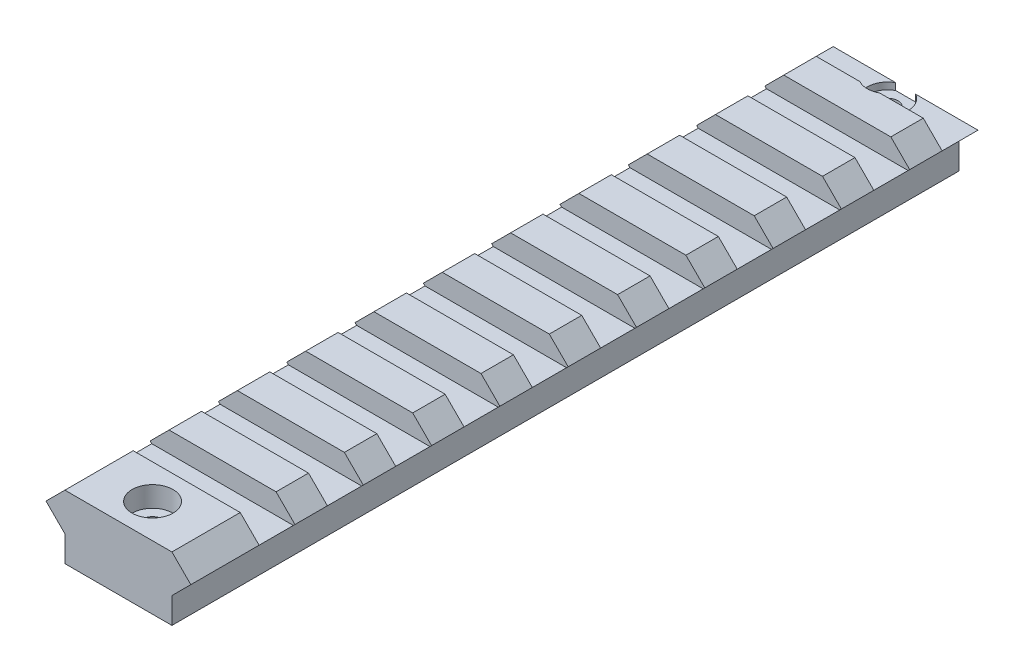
ISO-10303-21;
HEADER;
FILE_DESCRIPTION(('STEP AP214'),'2;1');
FILE_NAME('part.step','',(''),(''),'','','');
FILE_SCHEMA(('AUTOMOTIVE_DESIGN { 1 0 10303 214 1 1 1 1 }'));
ENDSEC;
DATA;
#1=APPLICATION_CONTEXT('core data for automotive mechanical design processes');
#2=APPLICATION_PROTOCOL_DEFINITION('international standard','automotive_design',2000,#1);
#3=PRODUCT_CONTEXT('',#1,'mechanical');
#4=PRODUCT('Part','Part','',(#3));
#5=PRODUCT_RELATED_PRODUCT_CATEGORY('part','',(#4));
#6=PRODUCT_DEFINITION_FORMATION('','',#4);
#7=PRODUCT_DEFINITION_CONTEXT('part definition',#1,'design');
#8=PRODUCT_DEFINITION('design','',#6,#7);
#9=PRODUCT_DEFINITION_SHAPE('','',#8);
#10=(LENGTH_UNIT() NAMED_UNIT(*) SI_UNIT(.MILLI.,.METRE.));
#11=(NAMED_UNIT(*) PLANE_ANGLE_UNIT() SI_UNIT($,.RADIAN.));
#12=(NAMED_UNIT(*) SI_UNIT($,.STERADIAN.) SOLID_ANGLE_UNIT());
#13=UNCERTAINTY_MEASURE_WITH_UNIT(LENGTH_MEASURE(1.E-05),#10,'distance_accuracy_value','');
#14=(GEOMETRIC_REPRESENTATION_CONTEXT(3) GLOBAL_UNCERTAINTY_ASSIGNED_CONTEXT((#13)) GLOBAL_UNIT_ASSIGNED_CONTEXT((#10,
#11,#12)) REPRESENTATION_CONTEXT('',''));
#15=CARTESIAN_POINT('',(0.,0.,0.));
#16=DIRECTION('',(0.,0.,1.));
#17=DIRECTION('',(1.,0.,0.));
#18=AXIS2_PLACEMENT_3D('',#15,#16,#17);
#19=CARTESIAN_POINT('',(0.,0.,-5.25));
#20=DIRECTION('',(0.,0.,1.));
#21=DIRECTION('',(1.,0.,0.));
#22=AXIS2_PLACEMENT_3D('',#19,#20,#21);
#23=PLANE('',#22);
#24=CARTESIAN_POINT('',(-24.0262438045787,22.5445565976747,-5.25));
#25=DIRECTION('',(0.,0.,-1.));
#26=DIRECTION('',(-1.,0.,0.));
#27=AXIS2_PLACEMENT_3D('',#24,#25,#26);
#28=CIRCLE('',#27,0.999999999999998);
#29=CARTESIAN_POINT('',(-25.0262438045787,22.5445565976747,-5.25));
#30=VERTEX_POINT('',#29);
#31=EDGE_CURVE('E589',#30,#30,#28,.T.);
#32=ORIENTED_EDGE('',*,*,#31,.F.);
#33=EDGE_LOOP('',(#32));
#34=FACE_BOUND('',#33,.T.);
#35=CARTESIAN_POINT('',(-12.3562438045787,22.5445565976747,-5.25));
#36=DIRECTION('',(0.,0.,-1.));
#37=DIRECTION('',(-1.,0.,0.));
#38=AXIS2_PLACEMENT_3D('',#35,#36,#37);
#39=CIRCLE('',#38,1.);
#40=CARTESIAN_POINT('',(-13.3562438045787,22.5445565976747,-5.25));
#41=VERTEX_POINT('',#40);
#42=EDGE_CURVE('E583',#41,#41,#39,.T.);
#43=ORIENTED_EDGE('',*,*,#42,.F.);
#44=EDGE_LOOP('',(#43));
#45=FACE_BOUND('',#44,.T.);
#46=DIRECTION('',(0.,-1.,0.));
#47=VECTOR('',#46,1.);
#48=CARTESIAN_POINT('',(-19.6436125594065,29.9695565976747,-5.25));
#49=LINE('',#48,#47);
#50=CARTESIAN_POINT('',(-19.6436125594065,26.2045565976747,-5.25));
#51=VERTEX_POINT('',#50);
#52=CARTESIAN_POINT('',(-19.6436125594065,27.2045565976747,-5.25));
#53=VERTEX_POINT('',#52);
#54=EDGE_CURVE('E569',#51,#53,#49,.F.);
#55=ORIENTED_EDGE('',*,*,#54,.F.);
#56=DIRECTION('',(-1.,0.,0.));
#57=VECTOR('',#56,1.);
#58=CARTESIAN_POINT('',(0.,26.2045565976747,-5.25));
#59=LINE('',#58,#57);
#60=CARTESIAN_POINT('',(-16.7388750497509,26.2045565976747,-5.25));
#61=VERTEX_POINT('',#60);
#62=EDGE_CURVE('E565',#61,#51,#59,.T.);
#63=ORIENTED_EDGE('',*,*,#62,.F.);
#64=DIRECTION('',(0.,-1.,0.));
#65=VECTOR('',#64,1.);
#66=CARTESIAN_POINT('',(-16.7388750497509,29.9695565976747,-5.25));
#67=LINE('',#66,#65);
#68=CARTESIAN_POINT('',(-16.7388750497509,27.2045565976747,-5.25));
#69=VERTEX_POINT('',#68);
#70=EDGE_CURVE('E553',#69,#61,#67,.T.);
#71=ORIENTED_EDGE('',*,*,#70,.F.);
#72=DIRECTION('',(1.,0.,0.));
#73=VECTOR('',#72,1.);
#74=CARTESIAN_POINT('',(-7.59124380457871,27.2045565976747,-5.25));
#75=LINE('',#74,#73);
#76=CARTESIAN_POINT('',(-7.59124380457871,27.2045565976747,-5.25));
#77=VERTEX_POINT('',#76);
#78=EDGE_CURVE('E661',#69,#77,#75,.T.);
#79=ORIENTED_EDGE('',*,*,#78,.T.);
#80=DIRECTION('',(-0.707106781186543,-0.707106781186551,0.));
#81=VECTOR('',#80,1.);
#82=CARTESIAN_POINT('',(-7.59124380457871,27.2045565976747,-5.25));
#83=LINE('',#82,#81);
#84=CARTESIAN_POINT('',(-10.3562438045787,24.4395565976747,-5.25));
#85=VERTEX_POINT('',#84);
#86=EDGE_CURVE('E660',#77,#85,#83,.T.);
#87=ORIENTED_EDGE('',*,*,#86,.T.);
#88=DIRECTION('',(0.,-1.,0.));
#89=VECTOR('',#88,1.);
#90=CARTESIAN_POINT('',(-10.3562438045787,24.4395565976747,-5.25));
#91=LINE('',#90,#89);
#92=CARTESIAN_POINT('',(-10.3562438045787,20.6495565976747,-5.25));
#93=VERTEX_POINT('',#92);
#94=EDGE_CURVE('E650',#85,#93,#91,.T.);
#95=ORIENTED_EDGE('',*,*,#94,.T.);
#96=DIRECTION('',(-1.,0.,0.));
#97=VECTOR('',#96,1.);
#98=CARTESIAN_POINT('',(-10.3562438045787,20.6495565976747,-5.25));
#99=LINE('',#98,#97);
#100=CARTESIAN_POINT('',(-13.1954375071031,20.6495565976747,-5.25));
#101=VERTEX_POINT('',#100);
#102=EDGE_CURVE('E654',#93,#101,#99,.T.);
#103=ORIENTED_EDGE('',*,*,#102,.T.);
#104=DIRECTION('',(0.,-1.,0.));
#105=VECTOR('',#104,1.);
#106=CARTESIAN_POINT('',(-13.1954375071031,0.,-5.25));
#107=LINE('',#106,#105);
#108=CARTESIAN_POINT('',(-13.1954375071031,21.4270565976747,-5.25));
#109=VERTEX_POINT('',#108);
#110=EDGE_CURVE('E623',#109,#101,#107,.T.);
#111=ORIENTED_EDGE('',*,*,#110,.F.);
#112=DIRECTION('',(-0.707106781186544,0.707106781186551,0.));
#113=VECTOR('',#112,1.);
#114=CARTESIAN_POINT('',(4.11580954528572,4.11580954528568,-5.25));
#115=LINE('',#114,#113);
#116=CARTESIAN_POINT('',(-14.1928559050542,22.4244749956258,-5.25));
#117=VERTEX_POINT('',#116);
#118=EDGE_CURVE('E1108',#109,#117,#115,.T.);
#119=ORIENTED_EDGE('',*,*,#118,.T.);
#120=DIRECTION('',(-0.529667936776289,-0.848205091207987,0.));
#121=VECTOR('',#120,1.);
#122=CARTESIAN_POINT('',(-20.2856543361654,12.6675267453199,-5.25));
#123=LINE('',#122,#121);
#124=CARTESIAN_POINT('',(-13.2545577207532,23.9270565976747,-5.25));
#125=VERTEX_POINT('',#124);
#126=EDGE_CURVE('E62',#125,#117,#123,.T.);
#127=ORIENTED_EDGE('',*,*,#126,.F.);
#128=DIRECTION('',(0.529667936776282,-0.848205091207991,0.));
#129=VECTOR('',#128,1.);
#130=CARTESIAN_POINT('',(1.21362148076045,0.7578549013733,-5.25));
#131=LINE('',#130,#129);
#132=CARTESIAN_POINT('',(-14.1912438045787,25.4270565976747,-5.25));
#133=VERTEX_POINT('',#132);
#134=EDGE_CURVE('E619',#133,#125,#131,.T.);
#135=ORIENTED_EDGE('',*,*,#134,.F.);
#136=DIRECTION('',(-1.,0.,0.));
#137=VECTOR('',#136,1.);
#138=CARTESIAN_POINT('',(0.,25.4270565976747,-5.25));
#139=LINE('',#138,#137);
#140=CARTESIAN_POINT('',(-22.1912438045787,25.4270565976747,-5.25));
#141=VERTEX_POINT('',#140);
#142=EDGE_CURVE('E616',#133,#141,#139,.T.);
#143=ORIENTED_EDGE('',*,*,#142,.T.);
#144=DIRECTION('',(-0.52966793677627,-0.848205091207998,0.));
#145=VECTOR('',#144,1.);
#146=CARTESIAN_POINT('',(-27.3890704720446,17.103307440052,-5.25));
#147=LINE('',#146,#145);
#148=CARTESIAN_POINT('',(-23.1279298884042,23.9270565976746,-5.25));
#149=VERTEX_POINT('',#148);
#150=EDGE_CURVE('E582',#141,#149,#147,.T.);
#151=ORIENTED_EDGE('',*,*,#150,.T.);
#152=DIRECTION('',(0.529667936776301,-0.84820509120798,0.));
#153=VECTOR('',#152,1.);
#154=CARTESIAN_POINT('',(-5.889794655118,-3.67792579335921,-5.25));
#155=LINE('',#154,#153);
#156=CARTESIAN_POINT('',(-22.1912438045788,22.4270565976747,-5.25));
#157=VERTEX_POINT('',#156);
#158=EDGE_CURVE('E596',#149,#157,#155,.T.);
#159=ORIENTED_EDGE('',*,*,#158,.T.);
#160=DIRECTION('',(0.707106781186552,0.707106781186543,0.));
#161=VECTOR('',#160,1.);
#162=CARTESIAN_POINT('',(-22.3091502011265,22.3091502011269,-5.25));
#163=LINE('',#162,#161);
#164=CARTESIAN_POINT('',(-23.1912438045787,21.4270565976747,-5.25));
#165=VERTEX_POINT('',#164);
#166=EDGE_CURVE('E1106',#157,#165,#163,.F.);
#167=ORIENTED_EDGE('',*,*,#166,.T.);
#168=DIRECTION('',(0.,-1.,0.));
#169=VECTOR('',#168,1.);
#170=CARTESIAN_POINT('',(-23.1912438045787,0.,-5.25));
#171=LINE('',#170,#169);
#172=CARTESIAN_POINT('',(-23.1912438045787,20.6495565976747,-5.25));
#173=VERTEX_POINT('',#172);
#174=EDGE_CURVE('E625',#165,#173,#171,.T.);
#175=ORIENTED_EDGE('',*,*,#174,.T.);
#176=CARTESIAN_POINT('',(-26.0262438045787,20.6495565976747,-5.25));
#177=VERTEX_POINT('',#176);
#178=EDGE_CURVE('E653',#173,#177,#99,.T.);
#179=ORIENTED_EDGE('',*,*,#178,.T.);
#180=DIRECTION('',(0.,1.,0.));
#181=VECTOR('',#180,1.);
#182=CARTESIAN_POINT('',(-26.0262438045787,20.6495565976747,-5.25));
#183=LINE('',#182,#181);
#184=CARTESIAN_POINT('',(-26.0262438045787,24.4395565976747,-5.25));
#185=VERTEX_POINT('',#184);
#186=EDGE_CURVE('E632',#177,#185,#183,.T.);
#187=ORIENTED_EDGE('',*,*,#186,.T.);
#188=DIRECTION('',(-0.707106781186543,0.707106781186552,0.));
#189=VECTOR('',#188,1.);
#190=CARTESIAN_POINT('',(-28.7912438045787,27.2045565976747,-5.25));
#191=LINE('',#190,#189);
#192=CARTESIAN_POINT('',(-28.7912438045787,27.2045565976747,-5.25));
#193=VERTEX_POINT('',#192);
#194=EDGE_CURVE('E664',#185,#193,#191,.T.);
#195=ORIENTED_EDGE('',*,*,#194,.T.);
#196=EDGE_CURVE('E658',#193,#53,#75,.T.);
#197=ORIENTED_EDGE('',*,*,#196,.T.);
#198=EDGE_LOOP('',(#55,#63,#71,#79,#87,#95,#103,#111,#119,#127,#135,#143,#151,#159,#167,#175,
#179,#187,#195,#197));
#199=FACE_BOUND('',#198,.T.);
#200=ADVANCED_FACE('F38',(#34,#45,#199),#23,.F.);
#201=CARTESIAN_POINT('',(0.,0.,0.));
#202=DIRECTION('',(0.,0.,1.));
#203=DIRECTION('',(1.,0.,0.));
#204=AXIS2_PLACEMENT_3D('',#201,#202,#203);
#205=PLANE('',#204);
#206=DIRECTION('',(0.,-1.,0.));
#207=VECTOR('',#206,1.);
#208=CARTESIAN_POINT('',(-19.6436125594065,29.9695565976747,0.));
#209=LINE('',#208,#207);
#210=CARTESIAN_POINT('',(-19.6436125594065,27.2045565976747,0.));
#211=VERTEX_POINT('',#210);
#212=CARTESIAN_POINT('',(-19.6436125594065,29.9695565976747,0.));
#213=VERTEX_POINT('',#212);
#214=EDGE_CURVE('E561',#211,#213,#209,.F.);
#215=ORIENTED_EDGE('',*,*,#214,.F.);
#216=DIRECTION('',(1.,0.,0.));
#217=VECTOR('',#216,1.);
#218=CARTESIAN_POINT('',(-7.59124380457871,27.2045565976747,0.));
#219=LINE('',#218,#217);
#220=CARTESIAN_POINT('',(-28.7912438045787,27.2045565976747,0.));
#221=VERTEX_POINT('',#220);
#222=EDGE_CURVE('E667',#221,#211,#219,.T.);
#223=ORIENTED_EDGE('',*,*,#222,.F.);
#224=DIRECTION('',(-0.707106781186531,-0.707106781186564,0.));
#225=VECTOR('',#224,1.);
#226=CARTESIAN_POINT('',(-27.9979002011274,27.9979002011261,0.));
#227=LINE('',#226,#225);
#228=CARTESIAN_POINT('',(-26.0262438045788,29.9695565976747,0.));
#229=VERTEX_POINT('',#228);
#230=EDGE_CURVE('E976',#229,#221,#227,.T.);
#231=ORIENTED_EDGE('',*,*,#230,.F.);
#232=DIRECTION('',(1.,0.,0.));
#233=VECTOR('',#232,1.);
#234=CARTESIAN_POINT('',(0.,29.9695565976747,0.));
#235=LINE('',#234,#233);
#236=EDGE_CURVE('E981',#229,#213,#235,.T.);
#237=ORIENTED_EDGE('',*,*,#236,.T.);
#238=EDGE_LOOP('',(#215,#223,#231,#237));
#239=FACE_BOUND('',#238,.T.);
#240=ADVANCED_FACE('F1172',(#239),#205,.F.);
#241=DIRECTION('',(0.,-1.,0.));
#242=VECTOR('',#241,1.);
#243=CARTESIAN_POINT('',(-16.7388750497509,29.9695565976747,0.));
#244=LINE('',#243,#242);
#245=CARTESIAN_POINT('',(-16.7388750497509,29.9695565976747,0.));
#246=VERTEX_POINT('',#245);
#247=CARTESIAN_POINT('',(-16.7388750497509,27.2045565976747,0.));
#248=VERTEX_POINT('',#247);
#249=EDGE_CURVE('E54',#246,#248,#244,.T.);
#250=ORIENTED_EDGE('',*,*,#249,.F.);
#251=CARTESIAN_POINT('',(-10.3562438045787,29.9695565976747,0.));
#252=VERTEX_POINT('',#251);
#253=EDGE_CURVE('E1005',#246,#252,#235,.T.);
#254=ORIENTED_EDGE('',*,*,#253,.T.);
#255=DIRECTION('',(0.707106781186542,-0.707106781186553,0.));
#256=VECTOR('',#255,1.);
#257=CARTESIAN_POINT('',(9.80665639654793,9.80665639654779,0.));
#258=LINE('',#257,#256);
#259=CARTESIAN_POINT('',(-7.59124380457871,27.2045565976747,0.));
#260=VERTEX_POINT('',#259);
#261=EDGE_CURVE('E1002',#252,#260,#258,.T.);
#262=ORIENTED_EDGE('',*,*,#261,.T.);
#263=EDGE_CURVE('E657',#248,#260,#219,.T.);
#264=ORIENTED_EDGE('',*,*,#263,.F.);
#265=EDGE_LOOP('',(#250,#254,#262,#264));
#266=FACE_BOUND('',#265,.T.);
#267=ADVANCED_FACE('F1183',(#266),#205,.F.);
#268=CARTESIAN_POINT('',(-7.59124380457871,27.2045565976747,-5.25));
#269=DIRECTION('',(0.,-1.,0.));
#270=DIRECTION('',(1.,0.,0.));
#271=AXIS2_PLACEMENT_3D('',#268,#269,#270);
#272=PLANE('',#271);
#273=CARTESIAN_POINT('',(-18.1912438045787,27.2045565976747,-2.625));
#274=DIRECTION('',(0.,-1.,0.));
#275=DIRECTION('',(1.,0.,0.));
#276=AXIS2_PLACEMENT_3D('',#273,#274,#275);
#277=CIRCLE('',#276,3.);
#278=EDGE_CURVE('E11',#53,#211,#277,.F.);
#279=ORIENTED_EDGE('',*,*,#278,.F.);
#280=ORIENTED_EDGE('',*,*,#196,.F.);
#281=DIRECTION('',(0.,0.,1.));
#282=VECTOR('',#281,1.);
#283=CARTESIAN_POINT('',(-28.7912438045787,27.2045565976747,-5.25));
#284=LINE('',#283,#282);
#285=EDGE_CURVE('E666',#193,#221,#284,.T.);
#286=ORIENTED_EDGE('',*,*,#285,.T.);
#287=ORIENTED_EDGE('',*,*,#222,.T.);
#288=EDGE_LOOP('',(#279,#280,#286,#287));
#289=FACE_BOUND('',#288,.T.);
#290=ADVANCED_FACE('F1168',(#289),#272,.F.);
#291=CARTESIAN_POINT('',(-18.1912438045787,20.6495565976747,-2.625));
#292=DIRECTION('',(0.,1.,0.));
#293=DIRECTION('',(-1.,0.,0.));
#294=AXIS2_PLACEMENT_3D('',#291,#292,#293);
#295=CYLINDRICAL_SURFACE('',#294,1.5);
#296=CARTESIAN_POINT('',(-18.1912438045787,25.4270565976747,-2.625));
#297=DIRECTION('',(0.,-1.,0.));
#298=DIRECTION('',(0.,0.,-1.));
#299=AXIS2_PLACEMENT_3D('',#296,#297,#298);
#300=CIRCLE('',#299,1.5);
#301=CARTESIAN_POINT('',(-18.1912438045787,25.4270565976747,-4.125));
#302=VERTEX_POINT('',#301);
#303=EDGE_CURVE('E578',#302,#302,#300,.T.);
#304=ORIENTED_EDGE('',*,*,#303,.T.);
#305=EDGE_LOOP('',(#304));
#306=FACE_BOUND('',#305,.T.);
#307=CARTESIAN_POINT('',(-18.1912438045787,26.2045565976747,-2.625));
#308=DIRECTION('',(0.,1.,0.));
#309=DIRECTION('',(-1.,0.,0.));
#310=AXIS2_PLACEMENT_3D('',#307,#308,#309);
#311=CIRCLE('',#310,1.5);
#312=CARTESIAN_POINT('',(-19.6912438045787,26.2045565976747,-2.625));
#313=VERTEX_POINT('',#312);
#314=EDGE_CURVE('E570',#313,#313,#311,.F.);
#315=ORIENTED_EDGE('',*,*,#314,.F.);
#316=EDGE_LOOP('',(#315));
#317=FACE_BOUND('',#316,.T.);
#318=ADVANCED_FACE('F1115',(#306,#317),#295,.F.);
#319=CARTESIAN_POINT('',(0.,20.6495565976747,110.));
#320=DIRECTION('',(0.,1.,0.));
#321=DIRECTION('',(-1.,0.,0.));
#322=AXIS2_PLACEMENT_3D('',#319,#320,#321);
#323=PLANE('',#322);
#324=CARTESIAN_POINT('',(-18.1912438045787,20.6495565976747,105.));
#325=DIRECTION('',(0.,1.,0.));
#326=DIRECTION('',(-1.,0.,0.));
#327=AXIS2_PLACEMENT_3D('',#324,#325,#326);
#328=CIRCLE('',#327,1.5);
#329=CARTESIAN_POINT('',(-19.6912438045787,20.6495565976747,105.));
#330=VERTEX_POINT('',#329);
#331=EDGE_CURVE('E676',#330,#330,#328,.T.);
#332=ORIENTED_EDGE('',*,*,#331,.T.);
#333=EDGE_LOOP('',(#332));
#334=FACE_BOUND('',#333,.T.);
#335=DIRECTION('',(0.,0.,-1.));
#336=VECTOR('',#335,1.);
#337=CARTESIAN_POINT('',(-23.1912438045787,20.6495565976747,9.75));
#338=LINE('',#337,#336);
#339=CARTESIAN_POINT('',(-23.1912438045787,20.6495565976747,9.75));
#340=VERTEX_POINT('',#339);
#341=EDGE_CURVE('E636',#340,#173,#338,.T.);
#342=ORIENTED_EDGE('',*,*,#341,.F.);
#343=DIRECTION('',(-1.,0.,0.));
#344=VECTOR('',#343,1.);
#345=CARTESIAN_POINT('',(0.,20.6495565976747,9.75));
#346=LINE('',#345,#344);
#347=CARTESIAN_POINT('',(-13.1954375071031,20.6495565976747,9.75));
#348=VERTEX_POINT('',#347);
#349=EDGE_CURVE('E605',#348,#340,#346,.T.);
#350=ORIENTED_EDGE('',*,*,#349,.F.);
#351=DIRECTION('',(0.,0.,-1.));
#352=VECTOR('',#351,1.);
#353=CARTESIAN_POINT('',(-13.1954375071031,20.6495565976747,9.75));
#354=LINE('',#353,#352);
#355=EDGE_CURVE('E639',#348,#101,#354,.T.);
#356=ORIENTED_EDGE('',*,*,#355,.T.);
#357=ORIENTED_EDGE('',*,*,#102,.F.);
#358=DIRECTION('',(0.,0.,-1.));
#359=VECTOR('',#358,1.);
#360=CARTESIAN_POINT('',(-10.3562438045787,20.6495565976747,110.));
#361=LINE('',#360,#359);
#362=CARTESIAN_POINT('',(-10.3562438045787,20.6495565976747,110.));
#363=VERTEX_POINT('',#362);
#364=EDGE_CURVE('E1024',#363,#93,#361,.T.);
#365=ORIENTED_EDGE('',*,*,#364,.F.);
#366=DIRECTION('',(1.,0.,0.));
#367=VECTOR('',#366,1.);
#368=CARTESIAN_POINT('',(0.,20.6495565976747,110.));
#369=LINE('',#368,#367);
#370=CARTESIAN_POINT('',(-26.0262438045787,20.6495565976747,110.));
#371=VERTEX_POINT('',#370);
#372=EDGE_CURVE('E986',#371,#363,#369,.T.);
#373=ORIENTED_EDGE('',*,*,#372,.F.);
#374=DIRECTION('',(0.,0.,-1.));
#375=VECTOR('',#374,1.);
#376=CARTESIAN_POINT('',(-26.0262438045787,20.6495565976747,110.));
#377=LINE('',#376,#375);
#378=EDGE_CURVE('E1026',#371,#177,#377,.T.);
#379=ORIENTED_EDGE('',*,*,#378,.T.);
#380=ORIENTED_EDGE('',*,*,#178,.F.);
#381=EDGE_LOOP('',(#342,#350,#356,#357,#365,#373,#379,#380));
#382=FACE_BOUND('',#381,.T.);
#383=ADVANCED_FACE('F1153',(#334,#382),#323,.F.);
#384=CARTESIAN_POINT('',(-27.9979002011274,27.9979002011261,110.));
#385=DIRECTION('',(0.707106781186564,-0.707106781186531,0.));
#386=DIRECTION('',(0.707106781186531,0.707106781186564,0.));
#387=AXIS2_PLACEMENT_3D('',#384,#385,#386);
#388=PLANE('',#387);
#389=DIRECTION('',(0.,0.,-1.));
#390=VECTOR('',#389,1.);
#391=CARTESIAN_POINT('',(-28.7912438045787,27.2045565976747,110.));
#392=LINE('',#391,#390);
#393=CARTESIAN_POINT('',(-28.7912438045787,27.2045565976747,4.75));
#394=VERTEX_POINT('',#393);
#395=EDGE_CURVE('E1031',#394,#221,#392,.T.);
#396=ORIENTED_EDGE('',*,*,#395,.F.);
#397=DIRECTION('',(0.707106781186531,0.707106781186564,0.));
#398=VECTOR('',#397,1.);
#399=CARTESIAN_POINT('',(-27.9979002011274,27.9979002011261,4.75));
#400=LINE('',#399,#398);
#401=CARTESIAN_POINT('',(-26.0262438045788,29.9695565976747,4.75));
#402=VERTEX_POINT('',#401);
#403=EDGE_CURVE('E944',#394,#402,#400,.T.);
#404=ORIENTED_EDGE('',*,*,#403,.T.);
#405=DIRECTION('',(0.,0.,-1.));
#406=VECTOR('',#405,1.);
#407=CARTESIAN_POINT('',(-26.0262438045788,29.9695565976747,110.));
#408=LINE('',#407,#406);
#409=EDGE_CURVE('E999',#402,#229,#408,.T.);
#410=ORIENTED_EDGE('',*,*,#409,.T.);
#411=ORIENTED_EDGE('',*,*,#230,.T.);
#412=EDGE_LOOP('',(#396,#404,#410,#411));
#413=FACE_BOUND('',#412,.T.);
#414=ADVANCED_FACE('F1308',(#413),#388,.F.);
#415=CARTESIAN_POINT('',(-26.0262438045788,29.9695565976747,14.75));
#416=VERTEX_POINT('',#415);
#417=CARTESIAN_POINT('',(-26.0262438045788,29.9695565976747,9.99999999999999));
#418=VERTEX_POINT('',#417);
#419=EDGE_CURVE('E1301',#416,#418,#408,.T.);
#420=ORIENTED_EDGE('',*,*,#419,.T.);
#421=DIRECTION('',(-0.707106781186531,-0.707106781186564,0.));
#422=VECTOR('',#421,1.);
#423=CARTESIAN_POINT('',(-27.9979002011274,27.9979002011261,9.99999999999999));
#424=LINE('',#423,#422);
#425=CARTESIAN_POINT('',(-28.7912438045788,27.2045565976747,10.));
#426=VERTEX_POINT('',#425);
#427=EDGE_CURVE('E934',#418,#426,#424,.T.);
#428=ORIENTED_EDGE('',*,*,#427,.T.);
#429=CARTESIAN_POINT('',(-28.7912438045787,27.2045565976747,14.75));
#430=VERTEX_POINT('',#429);
#431=EDGE_CURVE('E2191',#430,#426,#392,.T.);
#432=ORIENTED_EDGE('',*,*,#431,.F.);
#433=DIRECTION('',(0.707106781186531,0.707106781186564,0.));
#434=VECTOR('',#433,1.);
#435=CARTESIAN_POINT('',(-27.9979002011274,27.9979002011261,14.75));
#436=LINE('',#435,#434);
#437=EDGE_CURVE('E924',#430,#416,#436,.T.);
#438=ORIENTED_EDGE('',*,*,#437,.T.);
#439=EDGE_LOOP('',(#420,#428,#432,#438));
#440=FACE_BOUND('',#439,.T.);
#441=ADVANCED_FACE('F1736',(#440),#388,.F.);
#442=CARTESIAN_POINT('',(-26.0262438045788,29.9695565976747,24.75));
#443=VERTEX_POINT('',#442);
#444=CARTESIAN_POINT('',(-26.0262438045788,29.9695565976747,20.));
#445=VERTEX_POINT('',#444);
#446=EDGE_CURVE('E1297',#443,#445,#408,.T.);
#447=ORIENTED_EDGE('',*,*,#446,.T.);
#448=DIRECTION('',(-0.707106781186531,-0.707106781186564,0.));
#449=VECTOR('',#448,1.);
#450=CARTESIAN_POINT('',(-27.9979002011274,27.9979002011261,20.));
#451=LINE('',#450,#449);
#452=CARTESIAN_POINT('',(-28.7912438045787,27.2045565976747,20.));
#453=VERTEX_POINT('',#452);
#454=EDGE_CURVE('E914',#445,#453,#451,.T.);
#455=ORIENTED_EDGE('',*,*,#454,.T.);
#456=CARTESIAN_POINT('',(-28.7912438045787,27.2045565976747,24.75));
#457=VERTEX_POINT('',#456);
#458=EDGE_CURVE('E2192',#457,#453,#392,.T.);
#459=ORIENTED_EDGE('',*,*,#458,.F.);
#460=DIRECTION('',(0.707106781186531,0.707106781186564,0.));
#461=VECTOR('',#460,1.);
#462=CARTESIAN_POINT('',(-27.9979002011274,27.9979002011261,24.75));
#463=LINE('',#462,#461);
#464=EDGE_CURVE('E904',#457,#443,#463,.T.);
#465=ORIENTED_EDGE('',*,*,#464,.T.);
#466=EDGE_LOOP('',(#447,#455,#459,#465));
#467=FACE_BOUND('',#466,.T.);
#468=ADVANCED_FACE('F2161',(#467),#388,.F.);
#469=CARTESIAN_POINT('',(-26.0262438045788,29.9695565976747,34.75));
#470=VERTEX_POINT('',#469);
#471=CARTESIAN_POINT('',(-26.0262438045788,29.9695565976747,30.));
#472=VERTEX_POINT('',#471);
#473=EDGE_CURVE('E1293',#470,#472,#408,.T.);
#474=ORIENTED_EDGE('',*,*,#473,.T.);
#475=DIRECTION('',(-0.707106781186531,-0.707106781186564,0.));
#476=VECTOR('',#475,1.);
#477=CARTESIAN_POINT('',(-27.9979002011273,27.9979002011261,30.));
#478=LINE('',#477,#476);
#479=CARTESIAN_POINT('',(-28.7912438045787,27.2045565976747,30.));
#480=VERTEX_POINT('',#479);
#481=EDGE_CURVE('E894',#472,#480,#478,.T.);
#482=ORIENTED_EDGE('',*,*,#481,.T.);
#483=CARTESIAN_POINT('',(-28.7912438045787,27.2045565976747,34.75));
#484=VERTEX_POINT('',#483);
#485=EDGE_CURVE('E2194',#484,#480,#392,.T.);
#486=ORIENTED_EDGE('',*,*,#485,.F.);
#487=DIRECTION('',(0.707106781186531,0.707106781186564,0.));
#488=VECTOR('',#487,1.);
#489=CARTESIAN_POINT('',(-27.9979002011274,27.9979002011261,34.75));
#490=LINE('',#489,#488);
#491=EDGE_CURVE('E884',#484,#470,#490,.T.);
#492=ORIENTED_EDGE('',*,*,#491,.T.);
#493=EDGE_LOOP('',(#474,#482,#486,#492));
#494=FACE_BOUND('',#493,.T.);
#495=ADVANCED_FACE('F2153',(#494),#388,.F.);
#496=CARTESIAN_POINT('',(-26.0262438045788,29.9695565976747,44.75));
#497=VERTEX_POINT('',#496);
#498=CARTESIAN_POINT('',(-26.0262438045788,29.9695565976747,40.));
#499=VERTEX_POINT('',#498);
#500=EDGE_CURVE('E1289',#497,#499,#408,.T.);
#501=ORIENTED_EDGE('',*,*,#500,.T.);
#502=DIRECTION('',(-0.707106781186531,-0.707106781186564,0.));
#503=VECTOR('',#502,1.);
#504=CARTESIAN_POINT('',(-27.9979002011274,27.9979002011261,40.));
#505=LINE('',#504,#503);
#506=CARTESIAN_POINT('',(-28.7912438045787,27.2045565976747,40.));
#507=VERTEX_POINT('',#506);
#508=EDGE_CURVE('E874',#499,#507,#505,.T.);
#509=ORIENTED_EDGE('',*,*,#508,.T.);
#510=CARTESIAN_POINT('',(-28.7912438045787,27.2045565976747,44.75));
#511=VERTEX_POINT('',#510);
#512=EDGE_CURVE('E2197',#511,#507,#392,.T.);
#513=ORIENTED_EDGE('',*,*,#512,.F.);
#514=DIRECTION('',(0.707106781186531,0.707106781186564,0.));
#515=VECTOR('',#514,1.);
#516=CARTESIAN_POINT('',(-27.9979002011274,27.9979002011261,44.75));
#517=LINE('',#516,#515);
#518=EDGE_CURVE('E864',#511,#497,#517,.T.);
#519=ORIENTED_EDGE('',*,*,#518,.T.);
#520=EDGE_LOOP('',(#501,#509,#513,#519));
#521=FACE_BOUND('',#520,.T.);
#522=ADVANCED_FACE('F2145',(#521),#388,.F.);
#523=CARTESIAN_POINT('',(-26.0262438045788,29.9695565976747,54.75));
#524=VERTEX_POINT('',#523);
#525=CARTESIAN_POINT('',(-26.0262438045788,29.9695565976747,50.));
#526=VERTEX_POINT('',#525);
#527=EDGE_CURVE('E1285',#524,#526,#408,.T.);
#528=ORIENTED_EDGE('',*,*,#527,.T.);
#529=DIRECTION('',(-0.707106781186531,-0.707106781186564,0.));
#530=VECTOR('',#529,1.);
#531=CARTESIAN_POINT('',(-27.9979002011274,27.9979002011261,50.));
#532=LINE('',#531,#530);
#533=CARTESIAN_POINT('',(-28.7912438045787,27.2045565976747,50.));
#534=VERTEX_POINT('',#533);
#535=EDGE_CURVE('E854',#526,#534,#532,.T.);
#536=ORIENTED_EDGE('',*,*,#535,.T.);
#537=CARTESIAN_POINT('',(-28.7912438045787,27.2045565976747,54.75));
#538=VERTEX_POINT('',#537);
#539=EDGE_CURVE('E2200',#538,#534,#392,.T.);
#540=ORIENTED_EDGE('',*,*,#539,.F.);
#541=DIRECTION('',(0.707106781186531,0.707106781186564,0.));
#542=VECTOR('',#541,1.);
#543=CARTESIAN_POINT('',(-27.9979002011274,27.9979002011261,54.75));
#544=LINE('',#543,#542);
#545=EDGE_CURVE('E844',#538,#524,#544,.T.);
#546=ORIENTED_EDGE('',*,*,#545,.T.);
#547=EDGE_LOOP('',(#528,#536,#540,#546));
#548=FACE_BOUND('',#547,.T.);
#549=ADVANCED_FACE('F2137',(#548),#388,.F.);
#550=CARTESIAN_POINT('',(-26.0262438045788,29.9695565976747,64.75));
#551=VERTEX_POINT('',#550);
#552=CARTESIAN_POINT('',(-26.0262438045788,29.9695565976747,60.));
#553=VERTEX_POINT('',#552);
#554=EDGE_CURVE('E1281',#551,#553,#408,.T.);
#555=ORIENTED_EDGE('',*,*,#554,.T.);
#556=DIRECTION('',(-0.707106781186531,-0.707106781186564,0.));
#557=VECTOR('',#556,1.);
#558=CARTESIAN_POINT('',(-27.9979002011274,27.9979002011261,60.));
#559=LINE('',#558,#557);
#560=CARTESIAN_POINT('',(-28.7912438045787,27.2045565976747,60.));
#561=VERTEX_POINT('',#560);
#562=EDGE_CURVE('E834',#553,#561,#559,.T.);
#563=ORIENTED_EDGE('',*,*,#562,.T.);
#564=CARTESIAN_POINT('',(-28.7912438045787,27.2045565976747,64.75));
#565=VERTEX_POINT('',#564);
#566=EDGE_CURVE('E2203',#565,#561,#392,.T.);
#567=ORIENTED_EDGE('',*,*,#566,.F.);
#568=DIRECTION('',(0.707106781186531,0.707106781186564,0.));
#569=VECTOR('',#568,1.);
#570=CARTESIAN_POINT('',(-27.9979002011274,27.9979002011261,64.75));
#571=LINE('',#570,#569);
#572=EDGE_CURVE('E824',#565,#551,#571,.T.);
#573=ORIENTED_EDGE('',*,*,#572,.T.);
#574=EDGE_LOOP('',(#555,#563,#567,#573));
#575=FACE_BOUND('',#574,.T.);
#576=ADVANCED_FACE('F2129',(#575),#388,.F.);
#577=CARTESIAN_POINT('',(-26.0262438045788,29.9695565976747,74.75));
#578=VERTEX_POINT('',#577);
#579=CARTESIAN_POINT('',(-26.0262438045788,29.9695565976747,70.));
#580=VERTEX_POINT('',#579);
#581=EDGE_CURVE('E1277',#578,#580,#408,.T.);
#582=ORIENTED_EDGE('',*,*,#581,.T.);
#583=DIRECTION('',(-0.707106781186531,-0.707106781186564,0.));
#584=VECTOR('',#583,1.);
#585=CARTESIAN_POINT('',(-27.9979002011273,27.9979002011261,70.));
#586=LINE('',#585,#584);
#587=CARTESIAN_POINT('',(-28.7912438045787,27.2045565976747,70.));
#588=VERTEX_POINT('',#587);
#589=EDGE_CURVE('E814',#580,#588,#586,.T.);
#590=ORIENTED_EDGE('',*,*,#589,.T.);
#591=CARTESIAN_POINT('',(-28.7912438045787,27.2045565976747,74.75));
#592=VERTEX_POINT('',#591);
#593=EDGE_CURVE('E2206',#592,#588,#392,.T.);
#594=ORIENTED_EDGE('',*,*,#593,.F.);
#595=DIRECTION('',(0.707106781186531,0.707106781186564,0.));
#596=VECTOR('',#595,1.);
#597=CARTESIAN_POINT('',(-27.9979002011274,27.9979002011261,74.75));
#598=LINE('',#597,#596);
#599=EDGE_CURVE('E804',#592,#578,#598,.T.);
#600=ORIENTED_EDGE('',*,*,#599,.T.);
#601=EDGE_LOOP('',(#582,#590,#594,#600));
#602=FACE_BOUND('',#601,.T.);
#603=ADVANCED_FACE('F2121',(#602),#388,.F.);
#604=CARTESIAN_POINT('',(-26.0262438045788,29.9695565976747,84.75));
#605=VERTEX_POINT('',#604);
#606=CARTESIAN_POINT('',(-26.0262438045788,29.9695565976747,80.));
#607=VERTEX_POINT('',#606);
#608=EDGE_CURVE('E1275',#605,#607,#408,.T.);
#609=ORIENTED_EDGE('',*,*,#608,.T.);
#610=DIRECTION('',(-0.707106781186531,-0.707106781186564,0.));
#611=VECTOR('',#610,1.);
#612=CARTESIAN_POINT('',(-27.9979002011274,27.9979002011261,79.9999999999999));
#613=LINE('',#612,#611);
#614=CARTESIAN_POINT('',(-28.7912438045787,27.2045565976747,79.9999999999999));
#615=VERTEX_POINT('',#614);
#616=EDGE_CURVE('E794',#607,#615,#613,.T.);
#617=ORIENTED_EDGE('',*,*,#616,.T.);
#618=CARTESIAN_POINT('',(-28.7912438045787,27.2045565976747,84.75));
#619=VERTEX_POINT('',#618);
#620=EDGE_CURVE('E2209',#619,#615,#392,.T.);
#621=ORIENTED_EDGE('',*,*,#620,.F.);
#622=DIRECTION('',(0.707106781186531,0.707106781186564,0.));
#623=VECTOR('',#622,1.);
#624=CARTESIAN_POINT('',(-27.9979002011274,27.9979002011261,84.75));
#625=LINE('',#624,#623);
#626=EDGE_CURVE('E784',#619,#605,#625,.T.);
#627=ORIENTED_EDGE('',*,*,#626,.T.);
#628=EDGE_LOOP('',(#609,#617,#621,#627));
#629=FACE_BOUND('',#628,.T.);
#630=ADVANCED_FACE('F2113',(#629),#388,.F.);
#631=CARTESIAN_POINT('',(-26.0262438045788,29.9695565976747,94.7499999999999));
#632=VERTEX_POINT('',#631);
#633=CARTESIAN_POINT('',(-26.0262438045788,29.9695565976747,90.));
#634=VERTEX_POINT('',#633);
#635=EDGE_CURVE('E1012',#632,#634,#408,.T.);
#636=ORIENTED_EDGE('',*,*,#635,.T.);
#637=DIRECTION('',(-0.707106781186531,-0.707106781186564,0.));
#638=VECTOR('',#637,1.);
#639=CARTESIAN_POINT('',(-27.9979002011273,27.9979002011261,89.9999999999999));
#640=LINE('',#639,#638);
#641=CARTESIAN_POINT('',(-28.7912438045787,27.2045565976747,89.9999999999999));
#642=VERTEX_POINT('',#641);
#643=EDGE_CURVE('E774',#634,#642,#640,.T.);
#644=ORIENTED_EDGE('',*,*,#643,.T.);
#645=CARTESIAN_POINT('',(-28.7912438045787,27.2045565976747,94.7499999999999));
#646=VERTEX_POINT('',#645);
#647=EDGE_CURVE('E1036',#646,#642,#392,.T.);
#648=ORIENTED_EDGE('',*,*,#647,.F.);
#649=DIRECTION('',(0.707106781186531,0.707106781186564,0.));
#650=VECTOR('',#649,1.);
#651=CARTESIAN_POINT('',(-27.9979002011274,27.9979002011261,94.7499999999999));
#652=LINE('',#651,#650);
#653=EDGE_CURVE('E764',#646,#632,#652,.T.);
#654=ORIENTED_EDGE('',*,*,#653,.T.);
#655=EDGE_LOOP('',(#636,#644,#648,#654));
#656=FACE_BOUND('',#655,.T.);
#657=ADVANCED_FACE('F1271',(#656),#388,.F.);
#658=CARTESIAN_POINT('',(9.80665639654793,9.80665639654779,110.));
#659=DIRECTION('',(0.707106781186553,0.707106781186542,0.));
#660=DIRECTION('',(-0.707106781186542,0.707106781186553,0.));
#661=AXIS2_PLACEMENT_3D('',#658,#659,#660);
#662=PLANE('',#661);
#663=DIRECTION('',(-0.707106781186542,0.707106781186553,0.));
#664=VECTOR('',#663,1.);
#665=CARTESIAN_POINT('',(9.80665639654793,9.80665639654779,4.75));
#666=LINE('',#665,#664);
#667=CARTESIAN_POINT('',(-7.59124380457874,27.2045565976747,4.75));
#668=VERTEX_POINT('',#667);
#669=CARTESIAN_POINT('',(-10.3562438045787,29.9695565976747,4.75));
#670=VERTEX_POINT('',#669);
#671=EDGE_CURVE('E937',#668,#670,#666,.T.);
#672=ORIENTED_EDGE('',*,*,#671,.F.);
#673=DIRECTION('',(0.,0.,-1.));
#674=VECTOR('',#673,1.);
#675=CARTESIAN_POINT('',(-7.59124380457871,27.2045565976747,110.));
#676=LINE('',#675,#674);
#677=EDGE_CURVE('E1016',#668,#260,#676,.T.);
#678=ORIENTED_EDGE('',*,*,#677,.T.);
#679=ORIENTED_EDGE('',*,*,#261,.F.);
#680=DIRECTION('',(0.,0.,-1.));
#681=VECTOR('',#680,1.);
#682=CARTESIAN_POINT('',(-10.3562438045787,29.9695565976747,110.));
#683=LINE('',#682,#681);
#684=EDGE_CURVE('E1011',#670,#252,#683,.T.);
#685=ORIENTED_EDGE('',*,*,#684,.F.);
#686=EDGE_LOOP('',(#672,#678,#679,#685));
#687=FACE_BOUND('',#686,.T.);
#688=ADVANCED_FACE('F1192',(#687),#662,.T.);
#689=DIRECTION('',(0.707106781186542,-0.707106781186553,0.));
#690=VECTOR('',#689,1.);
#691=CARTESIAN_POINT('',(9.80665639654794,9.80665639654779,9.99999999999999));
#692=LINE('',#691,#690);
#693=CARTESIAN_POINT('',(-10.3562438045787,29.9695565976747,10.));
#694=VERTEX_POINT('',#693);
#695=CARTESIAN_POINT('',(-7.59124380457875,27.2045565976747,10.));
#696=VERTEX_POINT('',#695);
#697=EDGE_CURVE('E927',#694,#696,#692,.T.);
#698=ORIENTED_EDGE('',*,*,#697,.F.);
#699=CARTESIAN_POINT('',(-10.3562438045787,29.9695565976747,14.75));
#700=VERTEX_POINT('',#699);
#701=EDGE_CURVE('E1320',#700,#694,#683,.T.);
#702=ORIENTED_EDGE('',*,*,#701,.F.);
#703=DIRECTION('',(-0.707106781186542,0.707106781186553,0.));
#704=VECTOR('',#703,1.);
#705=CARTESIAN_POINT('',(9.80665639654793,9.80665639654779,14.75));
#706=LINE('',#705,#704);
#707=CARTESIAN_POINT('',(-7.59124380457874,27.2045565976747,14.75));
#708=VERTEX_POINT('',#707);
#709=EDGE_CURVE('E917',#708,#700,#706,.T.);
#710=ORIENTED_EDGE('',*,*,#709,.F.);
#711=EDGE_CURVE('E1196',#708,#696,#676,.T.);
#712=ORIENTED_EDGE('',*,*,#711,.T.);
#713=EDGE_LOOP('',(#698,#702,#710,#712));
#714=FACE_BOUND('',#713,.T.);
#715=ADVANCED_FACE('F1725',(#714),#662,.T.);
#716=DIRECTION('',(0.707106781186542,-0.707106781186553,0.));
#717=VECTOR('',#716,1.);
#718=CARTESIAN_POINT('',(9.80665639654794,9.80665639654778,20.));
#719=LINE('',#718,#717);
#720=CARTESIAN_POINT('',(-10.3562438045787,29.9695565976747,20.));
#721=VERTEX_POINT('',#720);
#722=CARTESIAN_POINT('',(-7.59124380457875,27.2045565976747,20.));
#723=VERTEX_POINT('',#722);
#724=EDGE_CURVE('E907',#721,#723,#719,.T.);
#725=ORIENTED_EDGE('',*,*,#724,.F.);
#726=CARTESIAN_POINT('',(-10.3562438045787,29.9695565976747,24.75));
#727=VERTEX_POINT('',#726);
#728=EDGE_CURVE('E1322',#727,#721,#683,.T.);
#729=ORIENTED_EDGE('',*,*,#728,.F.);
#730=DIRECTION('',(-0.707106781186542,0.707106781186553,0.));
#731=VECTOR('',#730,1.);
#732=CARTESIAN_POINT('',(9.80665639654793,9.80665639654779,24.75));
#733=LINE('',#732,#731);
#734=CARTESIAN_POINT('',(-7.59124380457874,27.2045565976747,24.75));
#735=VERTEX_POINT('',#734);
#736=EDGE_CURVE('E897',#735,#727,#733,.T.);
#737=ORIENTED_EDGE('',*,*,#736,.F.);
#738=EDGE_CURVE('E1198',#735,#723,#676,.T.);
#739=ORIENTED_EDGE('',*,*,#738,.T.);
#740=EDGE_LOOP('',(#725,#729,#737,#739));
#741=FACE_BOUND('',#740,.T.);
#742=ADVANCED_FACE('F2095',(#741),#662,.T.);
#743=DIRECTION('',(0.707106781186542,-0.707106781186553,0.));
#744=VECTOR('',#743,1.);
#745=CARTESIAN_POINT('',(9.80665639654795,9.80665639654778,30.));
#746=LINE('',#745,#744);
#747=CARTESIAN_POINT('',(-10.3562438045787,29.9695565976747,30.));
#748=VERTEX_POINT('',#747);
#749=CARTESIAN_POINT('',(-7.59124380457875,27.2045565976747,30.));
#750=VERTEX_POINT('',#749);
#751=EDGE_CURVE('E887',#748,#750,#746,.T.);
#752=ORIENTED_EDGE('',*,*,#751,.F.);
#753=CARTESIAN_POINT('',(-10.3562438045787,29.9695565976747,34.75));
#754=VERTEX_POINT('',#753);
#755=EDGE_CURVE('E1328',#754,#748,#683,.T.);
#756=ORIENTED_EDGE('',*,*,#755,.F.);
#757=DIRECTION('',(-0.707106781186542,0.707106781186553,0.));
#758=VECTOR('',#757,1.);
#759=CARTESIAN_POINT('',(9.80665639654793,9.80665639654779,34.75));
#760=LINE('',#759,#758);
#761=CARTESIAN_POINT('',(-7.59124380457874,27.2045565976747,34.75));
#762=VERTEX_POINT('',#761);
#763=EDGE_CURVE('E877',#762,#754,#760,.T.);
#764=ORIENTED_EDGE('',*,*,#763,.F.);
#765=EDGE_CURVE('E1204',#762,#750,#676,.T.);
#766=ORIENTED_EDGE('',*,*,#765,.T.);
#767=EDGE_LOOP('',(#752,#756,#764,#766));
#768=FACE_BOUND('',#767,.T.);
#769=ADVANCED_FACE('F2087',(#768),#662,.T.);
#770=DIRECTION('',(0.707106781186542,-0.707106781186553,0.));
#771=VECTOR('',#770,1.);
#772=CARTESIAN_POINT('',(9.80665639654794,9.80665639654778,40.));
#773=LINE('',#772,#771);
#774=CARTESIAN_POINT('',(-10.3562438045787,29.9695565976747,40.));
#775=VERTEX_POINT('',#774);
#776=CARTESIAN_POINT('',(-7.59124380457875,27.2045565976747,40.));
#777=VERTEX_POINT('',#776);
#778=EDGE_CURVE('E867',#775,#777,#773,.T.);
#779=ORIENTED_EDGE('',*,*,#778,.F.);
#780=CARTESIAN_POINT('',(-10.3562438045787,29.9695565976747,44.75));
#781=VERTEX_POINT('',#780);
#782=EDGE_CURVE('E1334',#781,#775,#683,.T.);
#783=ORIENTED_EDGE('',*,*,#782,.F.);
#784=DIRECTION('',(-0.707106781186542,0.707106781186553,0.));
#785=VECTOR('',#784,1.);
#786=CARTESIAN_POINT('',(9.80665639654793,9.80665639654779,44.75));
#787=LINE('',#786,#785);
#788=CARTESIAN_POINT('',(-7.59124380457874,27.2045565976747,44.75));
#789=VERTEX_POINT('',#788);
#790=EDGE_CURVE('E857',#789,#781,#787,.T.);
#791=ORIENTED_EDGE('',*,*,#790,.F.);
#792=EDGE_CURVE('E1210',#789,#777,#676,.T.);
#793=ORIENTED_EDGE('',*,*,#792,.T.);
#794=EDGE_LOOP('',(#779,#783,#791,#793));
#795=FACE_BOUND('',#794,.T.);
#796=ADVANCED_FACE('F2079',(#795),#662,.T.);
#797=DIRECTION('',(0.707106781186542,-0.707106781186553,0.));
#798=VECTOR('',#797,1.);
#799=CARTESIAN_POINT('',(9.80665639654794,9.80665639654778,50.));
#800=LINE('',#799,#798);
#801=CARTESIAN_POINT('',(-10.3562438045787,29.9695565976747,50.));
#802=VERTEX_POINT('',#801);
#803=CARTESIAN_POINT('',(-7.59124380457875,27.2045565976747,50.));
#804=VERTEX_POINT('',#803);
#805=EDGE_CURVE('E847',#802,#804,#800,.T.);
#806=ORIENTED_EDGE('',*,*,#805,.F.);
#807=CARTESIAN_POINT('',(-10.3562438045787,29.9695565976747,54.75));
#808=VERTEX_POINT('',#807);
#809=EDGE_CURVE('E1340',#808,#802,#683,.T.);
#810=ORIENTED_EDGE('',*,*,#809,.F.);
#811=DIRECTION('',(-0.707106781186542,0.707106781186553,0.));
#812=VECTOR('',#811,1.);
#813=CARTESIAN_POINT('',(9.80665639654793,9.80665639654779,54.75));
#814=LINE('',#813,#812);
#815=CARTESIAN_POINT('',(-7.59124380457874,27.2045565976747,54.75));
#816=VERTEX_POINT('',#815);
#817=EDGE_CURVE('E837',#816,#808,#814,.T.);
#818=ORIENTED_EDGE('',*,*,#817,.F.);
#819=EDGE_CURVE('E1216',#816,#804,#676,.T.);
#820=ORIENTED_EDGE('',*,*,#819,.T.);
#821=EDGE_LOOP('',(#806,#810,#818,#820));
#822=FACE_BOUND('',#821,.T.);
#823=ADVANCED_FACE('F2071',(#822),#662,.T.);
#824=DIRECTION('',(0.707106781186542,-0.707106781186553,0.));
#825=VECTOR('',#824,1.);
#826=CARTESIAN_POINT('',(9.80665639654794,9.80665639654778,60.));
#827=LINE('',#826,#825);
#828=CARTESIAN_POINT('',(-10.3562438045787,29.9695565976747,60.));
#829=VERTEX_POINT('',#828);
#830=CARTESIAN_POINT('',(-7.59124380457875,27.2045565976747,60.));
#831=VERTEX_POINT('',#830);
#832=EDGE_CURVE('E827',#829,#831,#827,.T.);
#833=ORIENTED_EDGE('',*,*,#832,.F.);
#834=CARTESIAN_POINT('',(-10.3562438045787,29.9695565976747,64.75));
#835=VERTEX_POINT('',#834);
#836=EDGE_CURVE('E1346',#835,#829,#683,.T.);
#837=ORIENTED_EDGE('',*,*,#836,.F.);
#838=DIRECTION('',(-0.707106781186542,0.707106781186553,0.));
#839=VECTOR('',#838,1.);
#840=CARTESIAN_POINT('',(9.80665639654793,9.80665639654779,64.75));
#841=LINE('',#840,#839);
#842=CARTESIAN_POINT('',(-7.59124380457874,27.2045565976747,64.75));
#843=VERTEX_POINT('',#842);
#844=EDGE_CURVE('E817',#843,#835,#841,.T.);
#845=ORIENTED_EDGE('',*,*,#844,.F.);
#846=EDGE_CURVE('E1222',#843,#831,#676,.T.);
#847=ORIENTED_EDGE('',*,*,#846,.T.);
#848=EDGE_LOOP('',(#833,#837,#845,#847));
#849=FACE_BOUND('',#848,.T.);
#850=ADVANCED_FACE('F2063',(#849),#662,.T.);
#851=DIRECTION('',(0.707106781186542,-0.707106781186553,0.));
#852=VECTOR('',#851,1.);
#853=CARTESIAN_POINT('',(9.80665639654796,9.80665639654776,70.));
#854=LINE('',#853,#852);
#855=CARTESIAN_POINT('',(-10.3562438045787,29.9695565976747,70.));
#856=VERTEX_POINT('',#855);
#857=CARTESIAN_POINT('',(-7.59124380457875,27.2045565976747,70.));
#858=VERTEX_POINT('',#857);
#859=EDGE_CURVE('E807',#856,#858,#854,.T.);
#860=ORIENTED_EDGE('',*,*,#859,.F.);
#861=CARTESIAN_POINT('',(-10.3562438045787,29.9695565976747,74.75));
#862=VERTEX_POINT('',#861);
#863=EDGE_CURVE('E1352',#862,#856,#683,.T.);
#864=ORIENTED_EDGE('',*,*,#863,.F.);
#865=DIRECTION('',(-0.707106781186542,0.707106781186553,0.));
#866=VECTOR('',#865,1.);
#867=CARTESIAN_POINT('',(9.80665639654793,9.80665639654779,74.75));
#868=LINE('',#867,#866);
#869=CARTESIAN_POINT('',(-7.59124380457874,27.2045565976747,74.75));
#870=VERTEX_POINT('',#869);
#871=EDGE_CURVE('E797',#870,#862,#868,.T.);
#872=ORIENTED_EDGE('',*,*,#871,.F.);
#873=EDGE_CURVE('E1228',#870,#858,#676,.T.);
#874=ORIENTED_EDGE('',*,*,#873,.T.);
#875=EDGE_LOOP('',(#860,#864,#872,#874));
#876=FACE_BOUND('',#875,.T.);
#877=ADVANCED_FACE('F2055',(#876),#662,.T.);
#878=DIRECTION('',(0.707106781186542,-0.707106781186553,0.));
#879=VECTOR('',#878,1.);
#880=CARTESIAN_POINT('',(9.80665639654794,9.80665639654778,80.));
#881=LINE('',#880,#879);
#882=CARTESIAN_POINT('',(-10.3562438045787,29.9695565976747,80.));
#883=VERTEX_POINT('',#882);
#884=CARTESIAN_POINT('',(-7.59124380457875,27.2045565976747,80.));
#885=VERTEX_POINT('',#884);
#886=EDGE_CURVE('E787',#883,#885,#881,.T.);
#887=ORIENTED_EDGE('',*,*,#886,.F.);
#888=CARTESIAN_POINT('',(-10.3562438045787,29.9695565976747,84.75));
#889=VERTEX_POINT('',#888);
#890=EDGE_CURVE('E1358',#889,#883,#683,.T.);
#891=ORIENTED_EDGE('',*,*,#890,.F.);
#892=DIRECTION('',(-0.707106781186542,0.707106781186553,0.));
#893=VECTOR('',#892,1.);
#894=CARTESIAN_POINT('',(9.80665639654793,9.80665639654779,84.75));
#895=LINE('',#894,#893);
#896=CARTESIAN_POINT('',(-7.59124380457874,27.2045565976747,84.75));
#897=VERTEX_POINT('',#896);
#898=EDGE_CURVE('E777',#897,#889,#895,.T.);
#899=ORIENTED_EDGE('',*,*,#898,.F.);
#900=EDGE_CURVE('E1234',#897,#885,#676,.T.);
#901=ORIENTED_EDGE('',*,*,#900,.T.);
#902=EDGE_LOOP('',(#887,#891,#899,#901));
#903=FACE_BOUND('',#902,.T.);
#904=ADVANCED_FACE('F2046',(#903),#662,.T.);
#905=DIRECTION('',(0.707106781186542,-0.707106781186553,0.));
#906=VECTOR('',#905,1.);
#907=CARTESIAN_POINT('',(9.80665639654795,9.80665639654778,90.));
#908=LINE('',#907,#906);
#909=CARTESIAN_POINT('',(-10.3562438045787,29.9695565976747,90.));
#910=VERTEX_POINT('',#909);
#911=CARTESIAN_POINT('',(-7.59124380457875,27.2045565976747,90.));
#912=VERTEX_POINT('',#911);
#913=EDGE_CURVE('E767',#910,#912,#908,.T.);
#914=ORIENTED_EDGE('',*,*,#913,.F.);
#915=CARTESIAN_POINT('',(-10.3562438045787,29.9695565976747,94.7499999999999));
#916=VERTEX_POINT('',#915);
#917=EDGE_CURVE('E1017',#916,#910,#683,.T.);
#918=ORIENTED_EDGE('',*,*,#917,.F.);
#919=DIRECTION('',(-0.707106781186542,0.707106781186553,0.));
#920=VECTOR('',#919,1.);
#921=CARTESIAN_POINT('',(9.80665639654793,9.80665639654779,94.7499999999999));
#922=LINE('',#921,#920);
#923=CARTESIAN_POINT('',(-7.59124380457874,27.2045565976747,94.7499999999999));
#924=VERTEX_POINT('',#923);
#925=EDGE_CURVE('E757',#924,#916,#922,.T.);
#926=ORIENTED_EDGE('',*,*,#925,.F.);
#927=EDGE_CURVE('E1022',#924,#912,#676,.T.);
#928=ORIENTED_EDGE('',*,*,#927,.T.);
#929=EDGE_LOOP('',(#914,#918,#926,#928));
#930=FACE_BOUND('',#929,.T.);
#931=ADVANCED_FACE('F1249',(#930),#662,.T.);
#932=CARTESIAN_POINT('',(0.,29.9695565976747,110.));
#933=DIRECTION('',(0.,1.,0.));
#934=DIRECTION('',(-1.,0.,0.));
#935=AXIS2_PLACEMENT_3D('',#932,#933,#934);
#936=PLANE('',#935);
#937=ORIENTED_EDGE('',*,*,#253,.F.);
#938=CARTESIAN_POINT('',(-18.1912438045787,29.9695565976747,-2.625));
#939=DIRECTION('',(0.,1.,0.));
#940=DIRECTION('',(-1.,0.,0.));
#941=AXIS2_PLACEMENT_3D('',#938,#939,#940);
#942=CIRCLE('',#941,3.);
#943=EDGE_CURVE('E566',#213,#246,#942,.T.);
#944=ORIENTED_EDGE('',*,*,#943,.F.);
#945=ORIENTED_EDGE('',*,*,#236,.F.);
#946=ORIENTED_EDGE('',*,*,#409,.F.);
#947=DIRECTION('',(-1.,0.,0.));
#948=VECTOR('',#947,1.);
#949=CARTESIAN_POINT('',(0.,29.9695565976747,4.75));
#950=LINE('',#949,#948);
#951=EDGE_CURVE('E1074',#670,#402,#950,.T.);
#952=ORIENTED_EDGE('',*,*,#951,.F.);
#953=ORIENTED_EDGE('',*,*,#684,.T.);
#954=EDGE_LOOP('',(#937,#944,#945,#946,#952,#953));
#955=FACE_BOUND('',#954,.T.);
#956=ADVANCED_FACE('F1178',(#955),#936,.T.);
#957=DIRECTION('',(1.,0.,0.));
#958=VECTOR('',#957,1.);
#959=CARTESIAN_POINT('',(0.,29.9695565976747,9.99999999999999));
#960=LINE('',#959,#958);
#961=EDGE_CURVE('E1072',#418,#694,#960,.T.);
#962=ORIENTED_EDGE('',*,*,#961,.F.);
#963=ORIENTED_EDGE('',*,*,#419,.F.);
#964=DIRECTION('',(-1.,0.,0.));
#965=VECTOR('',#964,1.);
#966=CARTESIAN_POINT('',(0.,29.9695565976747,14.75));
#967=LINE('',#966,#965);
#968=EDGE_CURVE('E1070',#700,#416,#967,.T.);
#969=ORIENTED_EDGE('',*,*,#968,.F.);
#970=ORIENTED_EDGE('',*,*,#701,.T.);
#971=EDGE_LOOP('',(#962,#963,#969,#970));
#972=FACE_BOUND('',#971,.T.);
#973=ADVANCED_FACE('F2028',(#972),#936,.T.);
#974=DIRECTION('',(1.,0.,0.));
#975=VECTOR('',#974,1.);
#976=CARTESIAN_POINT('',(0.,29.9695565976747,20.));
#977=LINE('',#976,#975);
#978=EDGE_CURVE('E1068',#445,#721,#977,.T.);
#979=ORIENTED_EDGE('',*,*,#978,.F.);
#980=ORIENTED_EDGE('',*,*,#446,.F.);
#981=DIRECTION('',(-1.,0.,0.));
#982=VECTOR('',#981,1.);
#983=CARTESIAN_POINT('',(0.,29.9695565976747,24.75));
#984=LINE('',#983,#982);
#985=EDGE_CURVE('E1066',#727,#443,#984,.T.);
#986=ORIENTED_EDGE('',*,*,#985,.F.);
#987=ORIENTED_EDGE('',*,*,#728,.T.);
#988=EDGE_LOOP('',(#979,#980,#986,#987));
#989=FACE_BOUND('',#988,.T.);
#990=ADVANCED_FACE('F2019',(#989),#936,.T.);
#991=DIRECTION('',(1.,0.,0.));
#992=VECTOR('',#991,1.);
#993=CARTESIAN_POINT('',(0.,29.9695565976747,30.));
#994=LINE('',#993,#992);
#995=EDGE_CURVE('E1064',#472,#748,#994,.T.);
#996=ORIENTED_EDGE('',*,*,#995,.F.);
#997=ORIENTED_EDGE('',*,*,#473,.F.);
#998=DIRECTION('',(-1.,0.,0.));
#999=VECTOR('',#998,1.);
#1000=CARTESIAN_POINT('',(0.,29.9695565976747,34.75));
#1001=LINE('',#1000,#999);
#1002=EDGE_CURVE('E1062',#754,#470,#1001,.T.);
#1003=ORIENTED_EDGE('',*,*,#1002,.F.);
#1004=ORIENTED_EDGE('',*,*,#755,.T.);
#1005=EDGE_LOOP('',(#996,#997,#1003,#1004));
#1006=FACE_BOUND('',#1005,.T.);
#1007=ADVANCED_FACE('F2010',(#1006),#936,.T.);
#1008=DIRECTION('',(1.,0.,0.));
#1009=VECTOR('',#1008,1.);
#1010=CARTESIAN_POINT('',(0.,29.9695565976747,40.));
#1011=LINE('',#1010,#1009);
#1012=EDGE_CURVE('E1060',#499,#775,#1011,.T.);
#1013=ORIENTED_EDGE('',*,*,#1012,.F.);
#1014=ORIENTED_EDGE('',*,*,#500,.F.);
#1015=DIRECTION('',(-1.,0.,0.));
#1016=VECTOR('',#1015,1.);
#1017=CARTESIAN_POINT('',(0.,29.9695565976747,44.75));
#1018=LINE('',#1017,#1016);
#1019=EDGE_CURVE('E1058',#781,#497,#1018,.T.);
#1020=ORIENTED_EDGE('',*,*,#1019,.F.);
#1021=ORIENTED_EDGE('',*,*,#782,.T.);
#1022=EDGE_LOOP('',(#1013,#1014,#1020,#1021));
#1023=FACE_BOUND('',#1022,.T.);
#1024=ADVANCED_FACE('F2001',(#1023),#936,.T.);
#1025=DIRECTION('',(1.,0.,0.));
#1026=VECTOR('',#1025,1.);
#1027=CARTESIAN_POINT('',(0.,29.9695565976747,50.));
#1028=LINE('',#1027,#1026);
#1029=EDGE_CURVE('E1056',#526,#802,#1028,.T.);
#1030=ORIENTED_EDGE('',*,*,#1029,.F.);
#1031=ORIENTED_EDGE('',*,*,#527,.F.);
#1032=DIRECTION('',(-1.,0.,0.));
#1033=VECTOR('',#1032,1.);
#1034=CARTESIAN_POINT('',(0.,29.9695565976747,54.75));
#1035=LINE('',#1034,#1033);
#1036=EDGE_CURVE('E1054',#808,#524,#1035,.T.);
#1037=ORIENTED_EDGE('',*,*,#1036,.F.);
#1038=ORIENTED_EDGE('',*,*,#809,.T.);
#1039=EDGE_LOOP('',(#1030,#1031,#1037,#1038));
#1040=FACE_BOUND('',#1039,.T.);
#1041=ADVANCED_FACE('F1992',(#1040),#936,.T.);
#1042=DIRECTION('',(1.,0.,0.));
#1043=VECTOR('',#1042,1.);
#1044=CARTESIAN_POINT('',(0.,29.9695565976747,60.));
#1045=LINE('',#1044,#1043);
#1046=EDGE_CURVE('E1052',#553,#829,#1045,.T.);
#1047=ORIENTED_EDGE('',*,*,#1046,.F.);
#1048=ORIENTED_EDGE('',*,*,#554,.F.);
#1049=DIRECTION('',(-1.,0.,0.));
#1050=VECTOR('',#1049,1.);
#1051=CARTESIAN_POINT('',(0.,29.9695565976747,64.75));
#1052=LINE('',#1051,#1050);
#1053=EDGE_CURVE('E1050',#835,#551,#1052,.T.);
#1054=ORIENTED_EDGE('',*,*,#1053,.F.);
#1055=ORIENTED_EDGE('',*,*,#836,.T.);
#1056=EDGE_LOOP('',(#1047,#1048,#1054,#1055));
#1057=FACE_BOUND('',#1056,.T.);
#1058=ADVANCED_FACE('F1983',(#1057),#936,.T.);
#1059=DIRECTION('',(1.,0.,0.));
#1060=VECTOR('',#1059,1.);
#1061=CARTESIAN_POINT('',(0.,29.9695565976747,70.));
#1062=LINE('',#1061,#1060);
#1063=EDGE_CURVE('E1048',#580,#856,#1062,.T.);
#1064=ORIENTED_EDGE('',*,*,#1063,.F.);
#1065=ORIENTED_EDGE('',*,*,#581,.F.);
#1066=DIRECTION('',(-1.,0.,0.));
#1067=VECTOR('',#1066,1.);
#1068=CARTESIAN_POINT('',(0.,29.9695565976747,74.75));
#1069=LINE('',#1068,#1067);
#1070=EDGE_CURVE('E1046',#862,#578,#1069,.T.);
#1071=ORIENTED_EDGE('',*,*,#1070,.F.);
#1072=ORIENTED_EDGE('',*,*,#863,.T.);
#1073=EDGE_LOOP('',(#1064,#1065,#1071,#1072));
#1074=FACE_BOUND('',#1073,.T.);
#1075=ADVANCED_FACE('F1974',(#1074),#936,.T.);
#1076=DIRECTION('',(1.,0.,0.));
#1077=VECTOR('',#1076,1.);
#1078=CARTESIAN_POINT('',(0.,29.9695565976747,80.));
#1079=LINE('',#1078,#1077);
#1080=EDGE_CURVE('E1044',#607,#883,#1079,.T.);
#1081=ORIENTED_EDGE('',*,*,#1080,.F.);
#1082=ORIENTED_EDGE('',*,*,#608,.F.);
#1083=DIRECTION('',(-1.,0.,0.));
#1084=VECTOR('',#1083,1.);
#1085=CARTESIAN_POINT('',(0.,29.9695565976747,84.75));
#1086=LINE('',#1085,#1084);
#1087=EDGE_CURVE('E1042',#889,#605,#1086,.T.);
#1088=ORIENTED_EDGE('',*,*,#1087,.F.);
#1089=ORIENTED_EDGE('',*,*,#890,.T.);
#1090=EDGE_LOOP('',(#1081,#1082,#1088,#1089));
#1091=FACE_BOUND('',#1090,.T.);
#1092=ADVANCED_FACE('F1964',(#1091),#936,.T.);
#1093=DIRECTION('',(1.,0.,0.));
#1094=VECTOR('',#1093,1.);
#1095=CARTESIAN_POINT('',(0.,29.9695565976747,90.));
#1096=LINE('',#1095,#1094);
#1097=EDGE_CURVE('E1040',#634,#910,#1096,.T.);
#1098=ORIENTED_EDGE('',*,*,#1097,.F.);
#1099=ORIENTED_EDGE('',*,*,#635,.F.);
#1100=DIRECTION('',(-1.,0.,0.));
#1101=VECTOR('',#1100,1.);
#1102=CARTESIAN_POINT('',(0.,29.9695565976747,94.7499999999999));
#1103=LINE('',#1102,#1101);
#1104=EDGE_CURVE('E1038',#916,#632,#1103,.T.);
#1105=ORIENTED_EDGE('',*,*,#1104,.F.);
#1106=ORIENTED_EDGE('',*,*,#917,.T.);
#1107=EDGE_LOOP('',(#1098,#1099,#1105,#1106));
#1108=FACE_BOUND('',#1107,.T.);
#1109=ADVANCED_FACE('F1368',(#1108),#936,.T.);
#1110=CARTESIAN_POINT('',(-26.0262438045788,29.9695565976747,110.));
#1111=VERTEX_POINT('',#1110);
#1112=CARTESIAN_POINT('',(-26.0262438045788,29.9695565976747,99.9999999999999));
#1113=VERTEX_POINT('',#1112);
#1114=EDGE_CURVE('E1008',#1111,#1113,#408,.T.);
#1115=ORIENTED_EDGE('',*,*,#1114,.T.);
#1116=DIRECTION('',(-0.707106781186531,-0.707106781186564,0.));
#1117=VECTOR('',#1116,1.);
#1118=CARTESIAN_POINT('',(-27.9979002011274,27.9979002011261,99.9999999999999));
#1119=LINE('',#1118,#1117);
#1120=CARTESIAN_POINT('',(-28.7912438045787,27.2045565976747,99.9999999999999));
#1121=VERTEX_POINT('',#1120);
#1122=EDGE_CURVE('E754',#1113,#1121,#1119,.T.);
#1123=ORIENTED_EDGE('',*,*,#1122,.T.);
#1124=CARTESIAN_POINT('',(-28.7912438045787,27.2045565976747,110.));
#1125=VERTEX_POINT('',#1124);
#1126=EDGE_CURVE('E1032',#1125,#1121,#392,.T.);
#1127=ORIENTED_EDGE('',*,*,#1126,.F.);
#1128=DIRECTION('',(-0.707106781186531,-0.707106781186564,0.));
#1129=VECTOR('',#1128,1.);
#1130=CARTESIAN_POINT('',(-27.9979002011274,27.9979002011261,110.));
#1131=LINE('',#1130,#1129);
#1132=EDGE_CURVE('E977',#1111,#1125,#1131,.T.);
#1133=ORIENTED_EDGE('',*,*,#1132,.F.);
#1134=EDGE_LOOP('',(#1115,#1123,#1127,#1133));
#1135=FACE_BOUND('',#1134,.T.);
#1136=ADVANCED_FACE('F1380',(#1135),#388,.F.);
#1137=CARTESIAN_POINT('',(-0.793343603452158,-0.793343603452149,110.));
#1138=DIRECTION('',(0.707106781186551,0.707106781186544,0.));
#1139=DIRECTION('',(-0.707106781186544,0.707106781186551,0.));
#1140=AXIS2_PLACEMENT_3D('',#1137,#1138,#1139);
#1141=PLANE('',#1140);
#1142=DIRECTION('',(0.,0.,1.));
#1143=VECTOR('',#1142,1.);
#1144=CARTESIAN_POINT('',(-28.5562438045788,26.9695565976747,110.));
#1145=LINE('',#1144,#1143);
#1146=CARTESIAN_POINT('',(-28.5562438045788,26.9695565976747,4.75));
#1147=VERTEX_POINT('',#1146);
#1148=CARTESIAN_POINT('',(-28.5562438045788,26.9695565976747,10.));
#1149=VERTEX_POINT('',#1148);
#1150=EDGE_CURVE('E974',#1147,#1149,#1145,.T.);
#1151=ORIENTED_EDGE('',*,*,#1150,.F.);
#1152=DIRECTION('',(-0.707106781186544,0.707106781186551,0.));
#1153=VECTOR('',#1152,1.);
#1154=CARTESIAN_POINT('',(-0.79334360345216,-0.793343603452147,4.75));
#1155=LINE('',#1154,#1153);
#1156=EDGE_CURVE('E941',#1147,#394,#1155,.T.);
#1157=ORIENTED_EDGE('',*,*,#1156,.T.);
#1158=ORIENTED_EDGE('',*,*,#395,.T.);
#1159=ORIENTED_EDGE('',*,*,#285,.F.);
#1160=ORIENTED_EDGE('',*,*,#194,.F.);
#1161=DIRECTION('',(0.,0.,-1.));
#1162=VECTOR('',#1161,1.);
#1163=CARTESIAN_POINT('',(-26.0262438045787,24.4395565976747,110.));
#1164=LINE('',#1163,#1162);
#1165=CARTESIAN_POINT('',(-26.0262438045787,24.4395565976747,110.));
#1166=VERTEX_POINT('',#1165);
#1167=EDGE_CURVE('E1029',#1166,#185,#1164,.T.);
#1168=ORIENTED_EDGE('',*,*,#1167,.F.);
#1169=DIRECTION('',(0.707106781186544,-0.707106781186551,0.));
#1170=VECTOR('',#1169,1.);
#1171=CARTESIAN_POINT('',(-0.793343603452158,-0.793343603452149,110.));
#1172=LINE('',#1171,#1170);
#1173=EDGE_CURVE('E980',#1125,#1166,#1172,.T.);
#1174=ORIENTED_EDGE('',*,*,#1173,.F.);
#1175=ORIENTED_EDGE('',*,*,#1126,.T.);
#1176=DIRECTION('',(0.707106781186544,-0.707106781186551,0.));
#1177=VECTOR('',#1176,1.);
#1178=CARTESIAN_POINT('',(-0.793343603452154,-0.793343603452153,99.9999999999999));
#1179=LINE('',#1178,#1177);
#1180=CARTESIAN_POINT('',(-28.5562438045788,26.9695565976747,99.9999999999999));
#1181=VERTEX_POINT('',#1180);
#1182=EDGE_CURVE('E751',#1121,#1181,#1179,.T.);
#1183=ORIENTED_EDGE('',*,*,#1182,.T.);
#1184=DIRECTION('',(0.,0.,-1.));
#1185=VECTOR('',#1184,1.);
#1186=CARTESIAN_POINT('',(-28.5562438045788,26.9695565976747,110.));
#1187=LINE('',#1186,#1185);
#1188=CARTESIAN_POINT('',(-28.5562438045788,26.9695565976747,94.7499999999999));
#1189=VERTEX_POINT('',#1188);
#1190=EDGE_CURVE('E947',#1181,#1189,#1187,.T.);
#1191=ORIENTED_EDGE('',*,*,#1190,.T.);
#1192=DIRECTION('',(-0.707106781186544,0.707106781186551,0.));
#1193=VECTOR('',#1192,1.);
#1194=CARTESIAN_POINT('',(-0.793343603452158,-0.793343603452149,94.7499999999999));
#1195=LINE('',#1194,#1193);
#1196=EDGE_CURVE('E761',#1189,#646,#1195,.T.);
#1197=ORIENTED_EDGE('',*,*,#1196,.T.);
#1198=ORIENTED_EDGE('',*,*,#647,.T.);
#1199=DIRECTION('',(0.707106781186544,-0.707106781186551,0.));
#1200=VECTOR('',#1199,1.);
#1201=CARTESIAN_POINT('',(-0.793343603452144,-0.793343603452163,90.));
#1202=LINE('',#1201,#1200);
#1203=CARTESIAN_POINT('',(-28.5562438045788,26.9695565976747,89.9999999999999));
#1204=VERTEX_POINT('',#1203);
#1205=EDGE_CURVE('E771',#642,#1204,#1202,.T.);
#1206=ORIENTED_EDGE('',*,*,#1205,.T.);
#1207=DIRECTION('',(0.,0.,-1.));
#1208=VECTOR('',#1207,1.);
#1209=CARTESIAN_POINT('',(-28.5562438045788,26.9695565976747,110.));
#1210=LINE('',#1209,#1208);
#1211=CARTESIAN_POINT('',(-28.5562438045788,26.9695565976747,84.75));
#1212=VERTEX_POINT('',#1211);
#1213=EDGE_CURVE('E950',#1204,#1212,#1210,.T.);
#1214=ORIENTED_EDGE('',*,*,#1213,.T.);
#1215=DIRECTION('',(-0.707106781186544,0.707106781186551,0.));
#1216=VECTOR('',#1215,1.);
#1217=CARTESIAN_POINT('',(-0.793343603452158,-0.793343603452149,84.75));
#1218=LINE('',#1217,#1216);
#1219=EDGE_CURVE('E781',#1212,#619,#1218,.T.);
#1220=ORIENTED_EDGE('',*,*,#1219,.T.);
#1221=ORIENTED_EDGE('',*,*,#620,.T.);
#1222=DIRECTION('',(0.707106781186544,-0.707106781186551,0.));
#1223=VECTOR('',#1222,1.);
#1224=CARTESIAN_POINT('',(-0.793343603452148,-0.793343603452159,80.));
#1225=LINE('',#1224,#1223);
#1226=CARTESIAN_POINT('',(-28.5562438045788,26.9695565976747,79.9999999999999));
#1227=VERTEX_POINT('',#1226);
#1228=EDGE_CURVE('E791',#615,#1227,#1225,.T.);
#1229=ORIENTED_EDGE('',*,*,#1228,.T.);
#1230=DIRECTION('',(0.,0.,-1.));
#1231=VECTOR('',#1230,1.);
#1232=CARTESIAN_POINT('',(-28.5562438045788,26.9695565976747,110.));
#1233=LINE('',#1232,#1231);
#1234=CARTESIAN_POINT('',(-28.5562438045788,26.9695565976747,74.75));
#1235=VERTEX_POINT('',#1234);
#1236=EDGE_CURVE('E953',#1227,#1235,#1233,.T.);
#1237=ORIENTED_EDGE('',*,*,#1236,.T.);
#1238=DIRECTION('',(-0.707106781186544,0.707106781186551,0.));
#1239=VECTOR('',#1238,1.);
#1240=CARTESIAN_POINT('',(-0.793343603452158,-0.793343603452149,74.75));
#1241=LINE('',#1240,#1239);
#1242=EDGE_CURVE('E801',#1235,#592,#1241,.T.);
#1243=ORIENTED_EDGE('',*,*,#1242,.T.);
#1244=ORIENTED_EDGE('',*,*,#593,.T.);
#1245=DIRECTION('',(0.707106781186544,-0.707106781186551,0.));
#1246=VECTOR('',#1245,1.);
#1247=CARTESIAN_POINT('',(-0.793343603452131,-0.793343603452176,70.));
#1248=LINE('',#1247,#1246);
#1249=CARTESIAN_POINT('',(-28.5562438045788,26.9695565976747,70.));
#1250=VERTEX_POINT('',#1249);
#1251=EDGE_CURVE('E811',#588,#1250,#1248,.T.);
#1252=ORIENTED_EDGE('',*,*,#1251,.T.);
#1253=DIRECTION('',(0.,0.,-1.));
#1254=VECTOR('',#1253,1.);
#1255=CARTESIAN_POINT('',(-28.5562438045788,26.9695565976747,110.));
#1256=LINE('',#1255,#1254);
#1257=CARTESIAN_POINT('',(-28.5562438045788,26.9695565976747,64.75));
#1258=VERTEX_POINT('',#1257);
#1259=EDGE_CURVE('E956',#1250,#1258,#1256,.T.);
#1260=ORIENTED_EDGE('',*,*,#1259,.T.);
#1261=DIRECTION('',(-0.707106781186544,0.707106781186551,0.));
#1262=VECTOR('',#1261,1.);
#1263=CARTESIAN_POINT('',(-0.793343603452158,-0.793343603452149,64.75));
#1264=LINE('',#1263,#1262);
#1265=EDGE_CURVE('E821',#1258,#565,#1264,.T.);
#1266=ORIENTED_EDGE('',*,*,#1265,.T.);
#1267=ORIENTED_EDGE('',*,*,#566,.T.);
#1268=DIRECTION('',(0.707106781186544,-0.707106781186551,0.));
#1269=VECTOR('',#1268,1.);
#1270=CARTESIAN_POINT('',(-0.793343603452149,-0.793343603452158,60.));
#1271=LINE('',#1270,#1269);
#1272=CARTESIAN_POINT('',(-28.5562438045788,26.9695565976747,60.));
#1273=VERTEX_POINT('',#1272);
#1274=EDGE_CURVE('E831',#561,#1273,#1271,.T.);
#1275=ORIENTED_EDGE('',*,*,#1274,.T.);
#1276=DIRECTION('',(0.,0.,-1.));
#1277=VECTOR('',#1276,1.);
#1278=CARTESIAN_POINT('',(-28.5562438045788,26.9695565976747,110.));
#1279=LINE('',#1278,#1277);
#1280=CARTESIAN_POINT('',(-28.5562438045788,26.9695565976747,54.75));
#1281=VERTEX_POINT('',#1280);
#1282=EDGE_CURVE('E959',#1273,#1281,#1279,.T.);
#1283=ORIENTED_EDGE('',*,*,#1282,.T.);
#1284=DIRECTION('',(-0.707106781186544,0.707106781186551,0.));
#1285=VECTOR('',#1284,1.);
#1286=CARTESIAN_POINT('',(-0.793343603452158,-0.793343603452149,54.75));
#1287=LINE('',#1286,#1285);
#1288=EDGE_CURVE('E841',#1281,#538,#1287,.T.);
#1289=ORIENTED_EDGE('',*,*,#1288,.T.);
#1290=ORIENTED_EDGE('',*,*,#539,.T.);
#1291=DIRECTION('',(0.707106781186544,-0.707106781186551,0.));
#1292=VECTOR('',#1291,1.);
#1293=CARTESIAN_POINT('',(-0.793343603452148,-0.793343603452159,50.));
#1294=LINE('',#1293,#1292);
#1295=CARTESIAN_POINT('',(-28.5562438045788,26.9695565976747,50.));
#1296=VERTEX_POINT('',#1295);
#1297=EDGE_CURVE('E851',#534,#1296,#1294,.T.);
#1298=ORIENTED_EDGE('',*,*,#1297,.T.);
#1299=DIRECTION('',(0.,0.,-1.));
#1300=VECTOR('',#1299,1.);
#1301=CARTESIAN_POINT('',(-28.5562438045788,26.9695565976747,110.));
#1302=LINE('',#1301,#1300);
#1303=CARTESIAN_POINT('',(-28.5562438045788,26.9695565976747,44.75));
#1304=VERTEX_POINT('',#1303);
#1305=EDGE_CURVE('E962',#1296,#1304,#1302,.T.);
#1306=ORIENTED_EDGE('',*,*,#1305,.T.);
#1307=DIRECTION('',(-0.707106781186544,0.707106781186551,0.));
#1308=VECTOR('',#1307,1.);
#1309=CARTESIAN_POINT('',(-0.793343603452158,-0.793343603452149,44.75));
#1310=LINE('',#1309,#1308);
#1311=EDGE_CURVE('E861',#1304,#511,#1310,.T.);
#1312=ORIENTED_EDGE('',*,*,#1311,.T.);
#1313=ORIENTED_EDGE('',*,*,#512,.T.);
#1314=DIRECTION('',(0.707106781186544,-0.707106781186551,0.));
#1315=VECTOR('',#1314,1.);
#1316=CARTESIAN_POINT('',(-0.793343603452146,-0.793343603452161,40.));
#1317=LINE('',#1316,#1315);
#1318=CARTESIAN_POINT('',(-28.5562438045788,26.9695565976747,40.));
#1319=VERTEX_POINT('',#1318);
#1320=EDGE_CURVE('E871',#507,#1319,#1317,.T.);
#1321=ORIENTED_EDGE('',*,*,#1320,.T.);
#1322=DIRECTION('',(0.,0.,-1.));
#1323=VECTOR('',#1322,1.);
#1324=CARTESIAN_POINT('',(-28.5562438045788,26.9695565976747,110.));
#1325=LINE('',#1324,#1323);
#1326=CARTESIAN_POINT('',(-28.5562438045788,26.9695565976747,34.75));
#1327=VERTEX_POINT('',#1326);
#1328=EDGE_CURVE('E965',#1319,#1327,#1325,.T.);
#1329=ORIENTED_EDGE('',*,*,#1328,.T.);
#1330=DIRECTION('',(-0.707106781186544,0.707106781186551,0.));
#1331=VECTOR('',#1330,1.);
#1332=CARTESIAN_POINT('',(-0.793343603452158,-0.793343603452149,34.75));
#1333=LINE('',#1332,#1331);
#1334=EDGE_CURVE('E881',#1327,#484,#1333,.T.);
#1335=ORIENTED_EDGE('',*,*,#1334,.T.);
#1336=ORIENTED_EDGE('',*,*,#485,.T.);
#1337=DIRECTION('',(0.707106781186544,-0.707106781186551,0.));
#1338=VECTOR('',#1337,1.);
#1339=CARTESIAN_POINT('',(-0.793343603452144,-0.793343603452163,30.));
#1340=LINE('',#1339,#1338);
#1341=CARTESIAN_POINT('',(-28.5562438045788,26.9695565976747,30.));
#1342=VERTEX_POINT('',#1341);
#1343=EDGE_CURVE('E891',#480,#1342,#1340,.T.);
#1344=ORIENTED_EDGE('',*,*,#1343,.T.);
#1345=DIRECTION('',(0.,0.,-1.));
#1346=VECTOR('',#1345,1.);
#1347=CARTESIAN_POINT('',(-28.5562438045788,26.9695565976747,110.));
#1348=LINE('',#1347,#1346);
#1349=CARTESIAN_POINT('',(-28.5562438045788,26.9695565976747,24.75));
#1350=VERTEX_POINT('',#1349);
#1351=EDGE_CURVE('E968',#1342,#1350,#1348,.T.);
#1352=ORIENTED_EDGE('',*,*,#1351,.T.);
#1353=DIRECTION('',(-0.707106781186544,0.707106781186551,0.));
#1354=VECTOR('',#1353,1.);
#1355=CARTESIAN_POINT('',(-0.793343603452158,-0.793343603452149,24.75));
#1356=LINE('',#1355,#1354);
#1357=EDGE_CURVE('E901',#1350,#457,#1356,.T.);
#1358=ORIENTED_EDGE('',*,*,#1357,.T.);
#1359=ORIENTED_EDGE('',*,*,#458,.T.);
#1360=DIRECTION('',(0.707106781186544,-0.707106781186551,0.));
#1361=VECTOR('',#1360,1.);
#1362=CARTESIAN_POINT('',(-0.79334360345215,-0.793343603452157,20.));
#1363=LINE('',#1362,#1361);
#1364=CARTESIAN_POINT('',(-28.5562438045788,26.9695565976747,20.));
#1365=VERTEX_POINT('',#1364);
#1366=EDGE_CURVE('E911',#453,#1365,#1363,.T.);
#1367=ORIENTED_EDGE('',*,*,#1366,.T.);
#1368=DIRECTION('',(0.,0.,-1.));
#1369=VECTOR('',#1368,1.);
#1370=CARTESIAN_POINT('',(-28.5562438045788,26.9695565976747,110.));
#1371=LINE('',#1370,#1369);
#1372=CARTESIAN_POINT('',(-28.5562438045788,26.9695565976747,14.75));
#1373=VERTEX_POINT('',#1372);
#1374=EDGE_CURVE('E971',#1365,#1373,#1371,.T.);
#1375=ORIENTED_EDGE('',*,*,#1374,.T.);
#1376=DIRECTION('',(-0.707106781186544,0.707106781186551,0.));
#1377=VECTOR('',#1376,1.);
#1378=CARTESIAN_POINT('',(-0.793343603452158,-0.793343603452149,14.75));
#1379=LINE('',#1378,#1377);
#1380=EDGE_CURVE('E921',#1373,#430,#1379,.T.);
#1381=ORIENTED_EDGE('',*,*,#1380,.T.);
#1382=ORIENTED_EDGE('',*,*,#431,.T.);
#1383=DIRECTION('',(0.707106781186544,-0.707106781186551,0.));
#1384=VECTOR('',#1383,1.);
#1385=CARTESIAN_POINT('',(-0.793343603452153,-0.793343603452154,9.99999999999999));
#1386=LINE('',#1385,#1384);
#1387=EDGE_CURVE('E931',#426,#1149,#1386,.T.);
#1388=ORIENTED_EDGE('',*,*,#1387,.T.);
#1389=EDGE_LOOP('',(#1151,#1157,#1158,#1159,#1160,#1168,#1174,#1175,#1183,#1191,#1197,#1198,
#1206,#1214,#1220,#1221,#1229,#1237,#1243,#1244,#1252,#1260,#1266,#1267,#1275,#1283,#1289,#1290,
#1298,#1306,#1312,#1313,#1321,#1329,#1335,#1336,#1344,#1352,#1358,#1359,#1367,#1375,#1381,#1382,#1388));
#1390=FACE_BOUND('',#1389,.T.);
#1391=ADVANCED_FACE('F1162',(#1390),#1141,.F.);
#1392=CARTESIAN_POINT('',(-26.0262438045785,-2.13146651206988E-13,110.));
#1393=DIRECTION('',(-1.,0.,0.));
#1394=DIRECTION('',(0.,-1.,0.));
#1395=AXIS2_PLACEMENT_3D('',#1392,#1393,#1394);
#1396=PLANE('',#1395);
#1397=ORIENTED_EDGE('',*,*,#1167,.T.);
#1398=ORIENTED_EDGE('',*,*,#186,.F.);
#1399=ORIENTED_EDGE('',*,*,#378,.F.);
#1400=DIRECTION('',(0.,1.,0.));
#1401=VECTOR('',#1400,1.);
#1402=CARTESIAN_POINT('',(-26.0262438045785,-2.13146651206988E-13,110.));
#1403=LINE('',#1402,#1401);
#1404=EDGE_CURVE('E983',#371,#1166,#1403,.T.);
#1405=ORIENTED_EDGE('',*,*,#1404,.T.);
#1406=EDGE_LOOP('',(#1397,#1398,#1399,#1405));
#1407=FACE_BOUND('',#1406,.T.);
#1408=ADVANCED_FACE('F1558',(#1407),#1396,.T.);
#1409=CARTESIAN_POINT('',(-10.3562438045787,0.,110.));
#1410=DIRECTION('',(-1.,0.,0.));
#1411=DIRECTION('',(0.,0.,1.));
#1412=AXIS2_PLACEMENT_3D('',#1409,#1410,#1411);
#1413=PLANE('',#1412);
#1414=ORIENTED_EDGE('',*,*,#364,.T.);
#1415=ORIENTED_EDGE('',*,*,#94,.F.);
#1416=DIRECTION('',(0.,0.,-1.));
#1417=VECTOR('',#1416,1.);
#1418=CARTESIAN_POINT('',(-10.3562438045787,24.4395565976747,110.));
#1419=LINE('',#1418,#1417);
#1420=CARTESIAN_POINT('',(-10.3562438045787,24.4395565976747,110.));
#1421=VERTEX_POINT('',#1420);
#1422=EDGE_CURVE('E1021',#1421,#85,#1419,.T.);
#1423=ORIENTED_EDGE('',*,*,#1422,.F.);
#1424=DIRECTION('',(0.,1.,0.));
#1425=VECTOR('',#1424,1.);
#1426=CARTESIAN_POINT('',(-10.3562438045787,0.,110.));
#1427=LINE('',#1426,#1425);
#1428=EDGE_CURVE('E988',#363,#1421,#1427,.T.);
#1429=ORIENTED_EDGE('',*,*,#1428,.F.);
#1430=EDGE_LOOP('',(#1414,#1415,#1423,#1429));
#1431=FACE_BOUND('',#1430,.T.);
#1432=ADVANCED_FACE('F1399',(#1431),#1413,.F.);
#1433=CARTESIAN_POINT('',(-17.3979002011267,17.3979002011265,110.));
#1434=DIRECTION('',(0.707106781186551,-0.707106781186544,0.));
#1435=DIRECTION('',(0.707106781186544,0.707106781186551,0.));
#1436=AXIS2_PLACEMENT_3D('',#1433,#1434,#1435);
#1437=PLANE('',#1436);
#1438=DIRECTION('',(0.707106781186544,0.707106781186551,0.));
#1439=VECTOR('',#1438,1.);
#1440=CARTESIAN_POINT('',(-17.3979002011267,17.3979002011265,4.75));
#1441=LINE('',#1440,#1439);
#1442=CARTESIAN_POINT('',(-7.82624380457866,26.9695565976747,4.75));
#1443=VERTEX_POINT('',#1442);
#1444=EDGE_CURVE('E939',#1443,#668,#1441,.T.);
#1445=ORIENTED_EDGE('',*,*,#1444,.F.);
#1446=DIRECTION('',(0.,0.,1.));
#1447=VECTOR('',#1446,1.);
#1448=CARTESIAN_POINT('',(-7.82624380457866,26.9695565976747,110.));
#1449=LINE('',#1448,#1447);
#1450=CARTESIAN_POINT('',(-7.82624380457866,26.9695565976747,10.));
#1451=VERTEX_POINT('',#1450);
#1452=EDGE_CURVE('E1094',#1443,#1451,#1449,.T.);
#1453=ORIENTED_EDGE('',*,*,#1452,.T.);
#1454=DIRECTION('',(-0.707106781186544,-0.707106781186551,0.));
#1455=VECTOR('',#1454,1.);
#1456=CARTESIAN_POINT('',(-17.3979002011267,17.3979002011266,9.99999999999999));
#1457=LINE('',#1456,#1455);
#1458=EDGE_CURVE('E929',#696,#1451,#1457,.T.);
#1459=ORIENTED_EDGE('',*,*,#1458,.F.);
#1460=ORIENTED_EDGE('',*,*,#711,.F.);
#1461=DIRECTION('',(0.707106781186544,0.707106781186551,0.));
#1462=VECTOR('',#1461,1.);
#1463=CARTESIAN_POINT('',(-17.3979002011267,17.3979002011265,14.75));
#1464=LINE('',#1463,#1462);
#1465=CARTESIAN_POINT('',(-7.82624380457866,26.9695565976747,14.75));
#1466=VERTEX_POINT('',#1465);
#1467=EDGE_CURVE('E919',#1466,#708,#1464,.T.);
#1468=ORIENTED_EDGE('',*,*,#1467,.F.);
#1469=DIRECTION('',(0.,0.,-1.));
#1470=VECTOR('',#1469,1.);
#1471=CARTESIAN_POINT('',(-7.82624380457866,26.9695565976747,110.));
#1472=LINE('',#1471,#1470);
#1473=CARTESIAN_POINT('',(-7.82624380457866,26.9695565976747,20.));
#1474=VERTEX_POINT('',#1473);
#1475=EDGE_CURVE('E1092',#1474,#1466,#1472,.T.);
#1476=ORIENTED_EDGE('',*,*,#1475,.F.);
#1477=DIRECTION('',(-0.707106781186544,-0.707106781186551,0.));
#1478=VECTOR('',#1477,1.);
#1479=CARTESIAN_POINT('',(-17.3979002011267,17.3979002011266,20.));
#1480=LINE('',#1479,#1478);
#1481=EDGE_CURVE('E909',#723,#1474,#1480,.T.);
#1482=ORIENTED_EDGE('',*,*,#1481,.F.);
#1483=ORIENTED_EDGE('',*,*,#738,.F.);
#1484=DIRECTION('',(0.707106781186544,0.707106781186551,0.));
#1485=VECTOR('',#1484,1.);
#1486=CARTESIAN_POINT('',(-17.3979002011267,17.3979002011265,24.75));
#1487=LINE('',#1486,#1485);
#1488=CARTESIAN_POINT('',(-7.82624380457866,26.9695565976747,24.75));
#1489=VERTEX_POINT('',#1488);
#1490=EDGE_CURVE('E899',#1489,#735,#1487,.T.);
#1491=ORIENTED_EDGE('',*,*,#1490,.F.);
#1492=DIRECTION('',(0.,0.,-1.));
#1493=VECTOR('',#1492,1.);
#1494=CARTESIAN_POINT('',(-7.82624380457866,26.9695565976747,110.));
#1495=LINE('',#1494,#1493);
#1496=CARTESIAN_POINT('',(-7.82624380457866,26.9695565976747,30.));
#1497=VERTEX_POINT('',#1496);
#1498=EDGE_CURVE('E1090',#1497,#1489,#1495,.T.);
#1499=ORIENTED_EDGE('',*,*,#1498,.F.);
#1500=DIRECTION('',(-0.707106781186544,-0.707106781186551,0.));
#1501=VECTOR('',#1500,1.);
#1502=CARTESIAN_POINT('',(-17.3979002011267,17.3979002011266,30.));
#1503=LINE('',#1502,#1501);
#1504=EDGE_CURVE('E889',#750,#1497,#1503,.T.);
#1505=ORIENTED_EDGE('',*,*,#1504,.F.);
#1506=ORIENTED_EDGE('',*,*,#765,.F.);
#1507=DIRECTION('',(0.707106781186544,0.707106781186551,0.));
#1508=VECTOR('',#1507,1.);
#1509=CARTESIAN_POINT('',(-17.3979002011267,17.3979002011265,34.75));
#1510=LINE('',#1509,#1508);
#1511=CARTESIAN_POINT('',(-7.82624380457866,26.9695565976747,34.75));
#1512=VERTEX_POINT('',#1511);
#1513=EDGE_CURVE('E879',#1512,#762,#1510,.T.);
#1514=ORIENTED_EDGE('',*,*,#1513,.F.);
#1515=DIRECTION('',(0.,0.,-1.));
#1516=VECTOR('',#1515,1.);
#1517=CARTESIAN_POINT('',(-7.82624380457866,26.9695565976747,110.));
#1518=LINE('',#1517,#1516);
#1519=CARTESIAN_POINT('',(-7.82624380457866,26.9695565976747,40.));
#1520=VERTEX_POINT('',#1519);
#1521=EDGE_CURVE('E1088',#1520,#1512,#1518,.T.);
#1522=ORIENTED_EDGE('',*,*,#1521,.F.);
#1523=DIRECTION('',(-0.707106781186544,-0.707106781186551,0.));
#1524=VECTOR('',#1523,1.);
#1525=CARTESIAN_POINT('',(-17.3979002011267,17.3979002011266,40.));
#1526=LINE('',#1525,#1524);
#1527=EDGE_CURVE('E869',#777,#1520,#1526,.T.);
#1528=ORIENTED_EDGE('',*,*,#1527,.F.);
#1529=ORIENTED_EDGE('',*,*,#792,.F.);
#1530=DIRECTION('',(0.707106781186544,0.707106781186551,0.));
#1531=VECTOR('',#1530,1.);
#1532=CARTESIAN_POINT('',(-17.3979002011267,17.3979002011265,44.75));
#1533=LINE('',#1532,#1531);
#1534=CARTESIAN_POINT('',(-7.82624380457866,26.9695565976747,44.75));
#1535=VERTEX_POINT('',#1534);
#1536=EDGE_CURVE('E859',#1535,#789,#1533,.T.);
#1537=ORIENTED_EDGE('',*,*,#1536,.F.);
#1538=DIRECTION('',(0.,0.,-1.));
#1539=VECTOR('',#1538,1.);
#1540=CARTESIAN_POINT('',(-7.82624380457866,26.9695565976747,110.));
#1541=LINE('',#1540,#1539);
#1542=CARTESIAN_POINT('',(-7.82624380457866,26.9695565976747,50.));
#1543=VERTEX_POINT('',#1542);
#1544=EDGE_CURVE('E1086',#1543,#1535,#1541,.T.);
#1545=ORIENTED_EDGE('',*,*,#1544,.F.);
#1546=DIRECTION('',(-0.707106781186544,-0.707106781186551,0.));
#1547=VECTOR('',#1546,1.);
#1548=CARTESIAN_POINT('',(-17.3979002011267,17.3979002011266,50.));
#1549=LINE('',#1548,#1547);
#1550=EDGE_CURVE('E849',#804,#1543,#1549,.T.);
#1551=ORIENTED_EDGE('',*,*,#1550,.F.);
#1552=ORIENTED_EDGE('',*,*,#819,.F.);
#1553=DIRECTION('',(0.707106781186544,0.707106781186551,0.));
#1554=VECTOR('',#1553,1.);
#1555=CARTESIAN_POINT('',(-17.3979002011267,17.3979002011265,54.75));
#1556=LINE('',#1555,#1554);
#1557=CARTESIAN_POINT('',(-7.82624380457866,26.9695565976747,54.75));
#1558=VERTEX_POINT('',#1557);
#1559=EDGE_CURVE('E839',#1558,#816,#1556,.T.);
#1560=ORIENTED_EDGE('',*,*,#1559,.F.);
#1561=DIRECTION('',(0.,0.,-1.));
#1562=VECTOR('',#1561,1.);
#1563=CARTESIAN_POINT('',(-7.82624380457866,26.9695565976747,110.));
#1564=LINE('',#1563,#1562);
#1565=CARTESIAN_POINT('',(-7.82624380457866,26.9695565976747,60.));
#1566=VERTEX_POINT('',#1565);
#1567=EDGE_CURVE('E1084',#1566,#1558,#1564,.T.);
#1568=ORIENTED_EDGE('',*,*,#1567,.F.);
#1569=DIRECTION('',(-0.707106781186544,-0.707106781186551,0.));
#1570=VECTOR('',#1569,1.);
#1571=CARTESIAN_POINT('',(-17.3979002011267,17.3979002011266,60.));
#1572=LINE('',#1571,#1570);
#1573=EDGE_CURVE('E829',#831,#1566,#1572,.T.);
#1574=ORIENTED_EDGE('',*,*,#1573,.F.);
#1575=ORIENTED_EDGE('',*,*,#846,.F.);
#1576=DIRECTION('',(0.707106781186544,0.707106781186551,0.));
#1577=VECTOR('',#1576,1.);
#1578=CARTESIAN_POINT('',(-17.3979002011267,17.3979002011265,64.75));
#1579=LINE('',#1578,#1577);
#1580=CARTESIAN_POINT('',(-7.82624380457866,26.9695565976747,64.75));
#1581=VERTEX_POINT('',#1580);
#1582=EDGE_CURVE('E819',#1581,#843,#1579,.T.);
#1583=ORIENTED_EDGE('',*,*,#1582,.F.);
#1584=DIRECTION('',(0.,0.,-1.));
#1585=VECTOR('',#1584,1.);
#1586=CARTESIAN_POINT('',(-7.82624380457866,26.9695565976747,110.));
#1587=LINE('',#1586,#1585);
#1588=CARTESIAN_POINT('',(-7.82624380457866,26.9695565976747,70.));
#1589=VERTEX_POINT('',#1588);
#1590=EDGE_CURVE('E1082',#1589,#1581,#1587,.T.);
#1591=ORIENTED_EDGE('',*,*,#1590,.F.);
#1592=DIRECTION('',(-0.707106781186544,-0.707106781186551,0.));
#1593=VECTOR('',#1592,1.);
#1594=CARTESIAN_POINT('',(-17.3979002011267,17.3979002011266,70.));
#1595=LINE('',#1594,#1593);
#1596=EDGE_CURVE('E809',#858,#1589,#1595,.T.);
#1597=ORIENTED_EDGE('',*,*,#1596,.F.);
#1598=ORIENTED_EDGE('',*,*,#873,.F.);
#1599=DIRECTION('',(0.707106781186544,0.707106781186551,0.));
#1600=VECTOR('',#1599,1.);
#1601=CARTESIAN_POINT('',(-17.3979002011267,17.3979002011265,74.75));
#1602=LINE('',#1601,#1600);
#1603=CARTESIAN_POINT('',(-7.82624380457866,26.9695565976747,74.75));
#1604=VERTEX_POINT('',#1603);
#1605=EDGE_CURVE('E799',#1604,#870,#1602,.T.);
#1606=ORIENTED_EDGE('',*,*,#1605,.F.);
#1607=DIRECTION('',(0.,0.,-1.));
#1608=VECTOR('',#1607,1.);
#1609=CARTESIAN_POINT('',(-7.82624380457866,26.9695565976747,110.));
#1610=LINE('',#1609,#1608);
#1611=CARTESIAN_POINT('',(-7.82624380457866,26.9695565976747,80.));
#1612=VERTEX_POINT('',#1611);
#1613=EDGE_CURVE('E1080',#1612,#1604,#1610,.T.);
#1614=ORIENTED_EDGE('',*,*,#1613,.F.);
#1615=DIRECTION('',(-0.707106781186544,-0.707106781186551,0.));
#1616=VECTOR('',#1615,1.);
#1617=CARTESIAN_POINT('',(-17.3979002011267,17.3979002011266,80.));
#1618=LINE('',#1617,#1616);
#1619=EDGE_CURVE('E789',#885,#1612,#1618,.T.);
#1620=ORIENTED_EDGE('',*,*,#1619,.F.);
#1621=ORIENTED_EDGE('',*,*,#900,.F.);
#1622=DIRECTION('',(0.707106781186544,0.707106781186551,0.));
#1623=VECTOR('',#1622,1.);
#1624=CARTESIAN_POINT('',(-17.3979002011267,17.3979002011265,84.75));
#1625=LINE('',#1624,#1623);
#1626=CARTESIAN_POINT('',(-7.82624380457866,26.9695565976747,84.75));
#1627=VERTEX_POINT('',#1626);
#1628=EDGE_CURVE('E779',#1627,#897,#1625,.T.);
#1629=ORIENTED_EDGE('',*,*,#1628,.F.);
#1630=DIRECTION('',(0.,0.,-1.));
#1631=VECTOR('',#1630,1.);
#1632=CARTESIAN_POINT('',(-7.82624380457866,26.9695565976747,110.));
#1633=LINE('',#1632,#1631);
#1634=CARTESIAN_POINT('',(-7.82624380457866,26.9695565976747,90.));
#1635=VERTEX_POINT('',#1634);
#1636=EDGE_CURVE('E1078',#1635,#1627,#1633,.T.);
#1637=ORIENTED_EDGE('',*,*,#1636,.F.);
#1638=DIRECTION('',(-0.707106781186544,-0.707106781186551,0.));
#1639=VECTOR('',#1638,1.);
#1640=CARTESIAN_POINT('',(-17.3979002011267,17.3979002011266,90.));
#1641=LINE('',#1640,#1639);
#1642=EDGE_CURVE('E769',#912,#1635,#1641,.T.);
#1643=ORIENTED_EDGE('',*,*,#1642,.F.);
#1644=ORIENTED_EDGE('',*,*,#927,.F.);
#1645=DIRECTION('',(0.707106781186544,0.707106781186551,0.));
#1646=VECTOR('',#1645,1.);
#1647=CARTESIAN_POINT('',(-17.3979002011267,17.3979002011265,94.7499999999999));
#1648=LINE('',#1647,#1646);
#1649=CARTESIAN_POINT('',(-7.82624380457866,26.9695565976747,94.7499999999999));
#1650=VERTEX_POINT('',#1649);
#1651=EDGE_CURVE('E759',#1650,#924,#1648,.T.);
#1652=ORIENTED_EDGE('',*,*,#1651,.F.);
#1653=DIRECTION('',(0.,0.,-1.));
#1654=VECTOR('',#1653,1.);
#1655=CARTESIAN_POINT('',(-7.82624380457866,26.9695565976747,110.));
#1656=LINE('',#1655,#1654);
#1657=CARTESIAN_POINT('',(-7.82624380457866,26.9695565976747,99.9999999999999));
#1658=VERTEX_POINT('',#1657);
#1659=EDGE_CURVE('E1076',#1658,#1650,#1656,.T.);
#1660=ORIENTED_EDGE('',*,*,#1659,.F.);
#1661=DIRECTION('',(-0.707106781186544,-0.707106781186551,0.));
#1662=VECTOR('',#1661,1.);
#1663=CARTESIAN_POINT('',(-17.3979002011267,17.3979002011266,99.9999999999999));
#1664=LINE('',#1663,#1662);
#1665=CARTESIAN_POINT('',(-7.59124380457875,27.2045565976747,99.9999999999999));
#1666=VERTEX_POINT('',#1665);
#1667=EDGE_CURVE('E749',#1666,#1658,#1664,.T.);
#1668=ORIENTED_EDGE('',*,*,#1667,.F.);
#1669=CARTESIAN_POINT('',(-7.59124380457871,27.2045565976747,110.));
#1670=VERTEX_POINT('',#1669);
#1671=EDGE_CURVE('E1018',#1670,#1666,#676,.T.);
#1672=ORIENTED_EDGE('',*,*,#1671,.F.);
#1673=DIRECTION('',(-0.707106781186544,-0.707106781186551,0.));
#1674=VECTOR('',#1673,1.);
#1675=CARTESIAN_POINT('',(-17.3979002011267,17.3979002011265,110.));
#1676=LINE('',#1675,#1674);
#1677=EDGE_CURVE('E990',#1670,#1421,#1676,.T.);
#1678=ORIENTED_EDGE('',*,*,#1677,.T.);
#1679=ORIENTED_EDGE('',*,*,#1422,.T.);
#1680=ORIENTED_EDGE('',*,*,#86,.F.);
#1681=DIRECTION('',(0.,0.,1.));
#1682=VECTOR('',#1681,1.);
#1683=CARTESIAN_POINT('',(-7.59124380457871,27.2045565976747,-5.25));
#1684=LINE('',#1683,#1682);
#1685=EDGE_CURVE('E672',#77,#260,#1684,.T.);
#1686=ORIENTED_EDGE('',*,*,#1685,.T.);
#1687=ORIENTED_EDGE('',*,*,#677,.F.);
#1688=EDGE_LOOP('',(#1445,#1453,#1459,#1460,#1468,#1476,#1482,#1483,#1491,#1499,#1505,#1506,
#1514,#1522,#1528,#1529,#1537,#1545,#1551,#1552,#1560,#1568,#1574,#1575,#1583,#1591,#1597,#1598,
#1606,#1614,#1620,#1621,#1629,#1637,#1643,#1644,#1652,#1660,#1668,#1672,#1678,#1679,#1680,#1686,#1687));
#1689=FACE_BOUND('',#1688,.T.);
#1690=ADVANCED_FACE('F1254',(#1689),#1437,.T.);
#1691=DIRECTION('',(0.707106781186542,-0.707106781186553,0.));
#1692=VECTOR('',#1691,1.);
#1693=CARTESIAN_POINT('',(9.80665639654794,9.80665639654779,100.));
#1694=LINE('',#1693,#1692);
#1695=CARTESIAN_POINT('',(-10.3562438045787,29.9695565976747,99.9999999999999));
#1696=VERTEX_POINT('',#1695);
#1697=EDGE_CURVE('E695',#1696,#1666,#1694,.T.);
#1698=ORIENTED_EDGE('',*,*,#1697,.F.);
#1699=CARTESIAN_POINT('',(-10.3562438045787,29.9695565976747,110.));
#1700=VERTEX_POINT('',#1699);
#1701=EDGE_CURVE('E1013',#1700,#1696,#683,.T.);
#1702=ORIENTED_EDGE('',*,*,#1701,.F.);
#1703=DIRECTION('',(0.707106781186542,-0.707106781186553,0.));
#1704=VECTOR('',#1703,1.);
#1705=CARTESIAN_POINT('',(9.80665639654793,9.80665639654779,110.));
#1706=LINE('',#1705,#1704);
#1707=EDGE_CURVE('E993',#1700,#1670,#1706,.T.);
#1708=ORIENTED_EDGE('',*,*,#1707,.T.);
#1709=ORIENTED_EDGE('',*,*,#1671,.T.);
#1710=EDGE_LOOP('',(#1698,#1702,#1708,#1709));
#1711=FACE_BOUND('',#1710,.T.);
#1712=ADVANCED_FACE('F1388',(#1711),#662,.T.);
#1713=CARTESIAN_POINT('',(-18.1912438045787,29.9695565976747,105.));
#1714=DIRECTION('',(0.,1.,0.));
#1715=DIRECTION('',(-1.,0.,0.));
#1716=AXIS2_PLACEMENT_3D('',#1713,#1714,#1715);
#1717=CIRCLE('',#1716,3.);
#1718=CARTESIAN_POINT('',(-21.1912438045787,29.9695565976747,105.));
#1719=VERTEX_POINT('',#1718);
#1720=EDGE_CURVE('E679',#1719,#1719,#1717,.T.);
#1721=ORIENTED_EDGE('',*,*,#1720,.F.);
#1722=EDGE_LOOP('',(#1721));
#1723=FACE_BOUND('',#1722,.T.);
#1724=DIRECTION('',(1.,0.,0.));
#1725=VECTOR('',#1724,1.);
#1726=CARTESIAN_POINT('',(0.,29.9695565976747,99.9999999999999));
#1727=LINE('',#1726,#1725);
#1728=EDGE_CURVE('E1035',#1113,#1696,#1727,.T.);
#1729=ORIENTED_EDGE('',*,*,#1728,.F.);
#1730=ORIENTED_EDGE('',*,*,#1114,.F.);
#1731=DIRECTION('',(1.,0.,0.));
#1732=VECTOR('',#1731,1.);
#1733=CARTESIAN_POINT('',(0.,29.9695565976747,110.));
#1734=LINE('',#1733,#1732);
#1735=EDGE_CURVE('E996',#1111,#1700,#1734,.T.);
#1736=ORIENTED_EDGE('',*,*,#1735,.T.);
#1737=ORIENTED_EDGE('',*,*,#1701,.T.);
#1738=EDGE_LOOP('',(#1729,#1730,#1736,#1737));
#1739=FACE_BOUND('',#1738,.T.);
#1740=ADVANCED_FACE('F1384',(#1723,#1739),#936,.T.);
#1741=CARTESIAN_POINT('',(0.,0.,110.));
#1742=DIRECTION('',(0.,0.,1.));
#1743=DIRECTION('',(1.,0.,0.));
#1744=AXIS2_PLACEMENT_3D('',#1741,#1742,#1743);
#1745=PLANE('',#1744);
#1746=ORIENTED_EDGE('',*,*,#1132,.T.);
#1747=ORIENTED_EDGE('',*,*,#1173,.T.);
#1748=ORIENTED_EDGE('',*,*,#1404,.F.);
#1749=ORIENTED_EDGE('',*,*,#372,.T.);
#1750=ORIENTED_EDGE('',*,*,#1428,.T.);
#1751=ORIENTED_EDGE('',*,*,#1677,.F.);
#1752=ORIENTED_EDGE('',*,*,#1707,.F.);
#1753=ORIENTED_EDGE('',*,*,#1735,.F.);
#1754=EDGE_LOOP('',(#1746,#1747,#1748,#1749,#1750,#1751,#1752,#1753));
#1755=FACE_BOUND('',#1754,.T.);
#1756=ADVANCED_FACE('F1392',(#1755),#1745,.T.);
#1757=CARTESIAN_POINT('',(0.,26.9695565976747,0.));
#1758=DIRECTION('',(0.,-1.,0.));
#1759=DIRECTION('',(1.,0.,0.));
#1760=AXIS2_PLACEMENT_3D('',#1757,#1758,#1759);
#1761=PLANE('',#1760);
#1762=DIRECTION('',(1.,0.,0.));
#1763=VECTOR('',#1762,1.);
#1764=CARTESIAN_POINT('',(-28.7912438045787,26.9695565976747,99.9999999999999));
#1765=LINE('',#1764,#1763);
#1766=EDGE_CURVE('E741',#1181,#1658,#1765,.T.);
#1767=ORIENTED_EDGE('',*,*,#1766,.T.);
#1768=ORIENTED_EDGE('',*,*,#1659,.T.);
#1769=DIRECTION('',(-1.,0.,0.));
#1770=VECTOR('',#1769,1.);
#1771=CARTESIAN_POINT('',(-28.7912438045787,26.9695565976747,94.7499999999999));
#1772=LINE('',#1771,#1770);
#1773=EDGE_CURVE('E685',#1650,#1189,#1772,.T.);
#1774=ORIENTED_EDGE('',*,*,#1773,.T.);
#1775=ORIENTED_EDGE('',*,*,#1190,.F.);
#1776=EDGE_LOOP('',(#1767,#1768,#1774,#1775));
#1777=FACE_BOUND('',#1776,.T.);
#1778=ADVANCED_FACE('F1373',(#1777),#1761,.F.);
#1779=CARTESIAN_POINT('',(-28.7912438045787,26.9695565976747,94.7499999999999));
#1780=DIRECTION('',(0.,0.,-1.));
#1781=DIRECTION('',(-1.,0.,0.));
#1782=AXIS2_PLACEMENT_3D('',#1779,#1780,#1781);
#1783=PLANE('',#1782);
#1784=ORIENTED_EDGE('',*,*,#1196,.F.);
#1785=ORIENTED_EDGE('',*,*,#1773,.F.);
#1786=ORIENTED_EDGE('',*,*,#1651,.T.);
#1787=ORIENTED_EDGE('',*,*,#925,.T.);
#1788=ORIENTED_EDGE('',*,*,#1104,.T.);
#1789=ORIENTED_EDGE('',*,*,#653,.F.);
#1790=EDGE_LOOP('',(#1784,#1785,#1786,#1787,#1788,#1789));
#1791=FACE_BOUND('',#1790,.T.);
#1792=ADVANCED_FACE('F1370',(#1791),#1783,.F.);
#1793=CARTESIAN_POINT('',(-28.7912438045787,26.9695565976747,99.9999999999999));
#1794=DIRECTION('',(0.,0.,1.));
#1795=DIRECTION('',(1.,0.,0.));
#1796=AXIS2_PLACEMENT_3D('',#1793,#1794,#1795);
#1797=PLANE('',#1796);
#1798=ORIENTED_EDGE('',*,*,#1728,.T.);
#1799=ORIENTED_EDGE('',*,*,#1697,.T.);
#1800=ORIENTED_EDGE('',*,*,#1667,.T.);
#1801=ORIENTED_EDGE('',*,*,#1766,.F.);
#1802=ORIENTED_EDGE('',*,*,#1182,.F.);
#1803=ORIENTED_EDGE('',*,*,#1122,.F.);
#1804=EDGE_LOOP('',(#1798,#1799,#1800,#1801,#1802,#1803));
#1805=FACE_BOUND('',#1804,.T.);
#1806=ADVANCED_FACE('F1377',(#1805),#1797,.F.);
#1807=CARTESIAN_POINT('',(0.,26.9695565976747,0.));
#1808=DIRECTION('',(0.,-1.,0.));
#1809=DIRECTION('',(1.,0.,0.));
#1810=AXIS2_PLACEMENT_3D('',#1807,#1808,#1809);
#1811=PLANE('',#1810);
#1812=DIRECTION('',(1.,0.,0.));
#1813=VECTOR('',#1812,1.);
#1814=CARTESIAN_POINT('',(-28.7912438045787,26.9695565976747,89.9999999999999));
#1815=LINE('',#1814,#1813);
#1816=EDGE_CURVE('E735',#1204,#1635,#1815,.T.);
#1817=ORIENTED_EDGE('',*,*,#1816,.T.);
#1818=ORIENTED_EDGE('',*,*,#1636,.T.);
#1819=DIRECTION('',(-1.,0.,0.));
#1820=VECTOR('',#1819,1.);
#1821=CARTESIAN_POINT('',(-28.7912438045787,26.9695565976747,84.75));
#1822=LINE('',#1821,#1820);
#1823=EDGE_CURVE('E738',#1627,#1212,#1822,.T.);
#1824=ORIENTED_EDGE('',*,*,#1823,.T.);
#1825=ORIENTED_EDGE('',*,*,#1213,.F.);
#1826=EDGE_LOOP('',(#1817,#1818,#1824,#1825));
#1827=FACE_BOUND('',#1826,.T.);
#1828=ADVANCED_FACE('F1262',(#1827),#1811,.F.);
#1829=CARTESIAN_POINT('',(-28.7912438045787,26.9695565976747,84.75));
#1830=DIRECTION('',(0.,0.,-1.));
#1831=DIRECTION('',(-1.,0.,0.));
#1832=AXIS2_PLACEMENT_3D('',#1829,#1830,#1831);
#1833=PLANE('',#1832);
#1834=ORIENTED_EDGE('',*,*,#1219,.F.);
#1835=ORIENTED_EDGE('',*,*,#1823,.F.);
#1836=ORIENTED_EDGE('',*,*,#1628,.T.);
#1837=ORIENTED_EDGE('',*,*,#898,.T.);
#1838=ORIENTED_EDGE('',*,*,#1087,.T.);
#1839=ORIENTED_EDGE('',*,*,#626,.F.);
#1840=EDGE_LOOP('',(#1834,#1835,#1836,#1837,#1838,#1839));
#1841=FACE_BOUND('',#1840,.T.);
#1842=ADVANCED_FACE('F1535',(#1841),#1833,.F.);
#1843=CARTESIAN_POINT('',(-28.7912438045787,26.9695565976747,89.9999999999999));
#1844=DIRECTION('',(0.,0.,1.));
#1845=DIRECTION('',(1.,0.,0.));
#1846=AXIS2_PLACEMENT_3D('',#1843,#1844,#1845);
#1847=PLANE('',#1846);
#1848=ORIENTED_EDGE('',*,*,#1097,.T.);
#1849=ORIENTED_EDGE('',*,*,#913,.T.);
#1850=ORIENTED_EDGE('',*,*,#1642,.T.);
#1851=ORIENTED_EDGE('',*,*,#1816,.F.);
#1852=ORIENTED_EDGE('',*,*,#1205,.F.);
#1853=ORIENTED_EDGE('',*,*,#643,.F.);
#1854=EDGE_LOOP('',(#1848,#1849,#1850,#1851,#1852,#1853));
#1855=FACE_BOUND('',#1854,.T.);
#1856=ADVANCED_FACE('F1260',(#1855),#1847,.F.);
#1857=CARTESIAN_POINT('',(0.,26.9695565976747,0.));
#1858=DIRECTION('',(0.,-1.,0.));
#1859=DIRECTION('',(1.,0.,0.));
#1860=AXIS2_PLACEMENT_3D('',#1857,#1858,#1859);
#1861=PLANE('',#1860);
#1862=DIRECTION('',(1.,0.,0.));
#1863=VECTOR('',#1862,1.);
#1864=CARTESIAN_POINT('',(-28.7912438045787,26.9695565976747,79.9999999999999));
#1865=LINE('',#1864,#1863);
#1866=EDGE_CURVE('E729',#1227,#1612,#1865,.T.);
#1867=ORIENTED_EDGE('',*,*,#1866,.T.);
#1868=ORIENTED_EDGE('',*,*,#1613,.T.);
#1869=DIRECTION('',(-1.,0.,0.));
#1870=VECTOR('',#1869,1.);
#1871=CARTESIAN_POINT('',(-28.7912438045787,26.9695565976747,74.75));
#1872=LINE('',#1871,#1870);
#1873=EDGE_CURVE('E732',#1604,#1235,#1872,.T.);
#1874=ORIENTED_EDGE('',*,*,#1873,.T.);
#1875=ORIENTED_EDGE('',*,*,#1236,.F.);
#1876=EDGE_LOOP('',(#1867,#1868,#1874,#1875));
#1877=FACE_BOUND('',#1876,.T.);
#1878=ADVANCED_FACE('F1522',(#1877),#1861,.F.);
#1879=CARTESIAN_POINT('',(-28.7912438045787,26.9695565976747,74.75));
#1880=DIRECTION('',(0.,0.,-1.));
#1881=DIRECTION('',(-1.,0.,0.));
#1882=AXIS2_PLACEMENT_3D('',#1879,#1880,#1881);
#1883=PLANE('',#1882);
#1884=ORIENTED_EDGE('',*,*,#1242,.F.);
#1885=ORIENTED_EDGE('',*,*,#1873,.F.);
#1886=ORIENTED_EDGE('',*,*,#1605,.T.);
#1887=ORIENTED_EDGE('',*,*,#871,.T.);
#1888=ORIENTED_EDGE('',*,*,#1070,.T.);
#1889=ORIENTED_EDGE('',*,*,#599,.F.);
#1890=EDGE_LOOP('',(#1884,#1885,#1886,#1887,#1888,#1889));
#1891=FACE_BOUND('',#1890,.T.);
#1892=ADVANCED_FACE('F1525',(#1891),#1883,.F.);
#1893=CARTESIAN_POINT('',(-28.7912438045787,26.9695565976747,79.9999999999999));
#1894=DIRECTION('',(0.,0.,1.));
#1895=DIRECTION('',(1.,0.,0.));
#1896=AXIS2_PLACEMENT_3D('',#1893,#1894,#1895);
#1897=PLANE('',#1896);
#1898=ORIENTED_EDGE('',*,*,#1080,.T.);
#1899=ORIENTED_EDGE('',*,*,#886,.T.);
#1900=ORIENTED_EDGE('',*,*,#1619,.T.);
#1901=ORIENTED_EDGE('',*,*,#1866,.F.);
#1902=ORIENTED_EDGE('',*,*,#1228,.F.);
#1903=ORIENTED_EDGE('',*,*,#616,.F.);
#1904=EDGE_LOOP('',(#1898,#1899,#1900,#1901,#1902,#1903));
#1905=FACE_BOUND('',#1904,.T.);
#1906=ADVANCED_FACE('F1514',(#1905),#1897,.F.);
#1907=CARTESIAN_POINT('',(0.,26.9695565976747,0.));
#1908=DIRECTION('',(0.,-1.,0.));
#1909=DIRECTION('',(1.,0.,0.));
#1910=AXIS2_PLACEMENT_3D('',#1907,#1908,#1909);
#1911=PLANE('',#1910);
#1912=DIRECTION('',(1.,0.,0.));
#1913=VECTOR('',#1912,1.);
#1914=CARTESIAN_POINT('',(-28.7912438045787,26.9695565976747,70.));
#1915=LINE('',#1914,#1913);
#1916=EDGE_CURVE('E723',#1250,#1589,#1915,.T.);
#1917=ORIENTED_EDGE('',*,*,#1916,.T.);
#1918=ORIENTED_EDGE('',*,*,#1590,.T.);
#1919=DIRECTION('',(-1.,0.,0.));
#1920=VECTOR('',#1919,1.);
#1921=CARTESIAN_POINT('',(-28.7912438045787,26.9695565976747,64.75));
#1922=LINE('',#1921,#1920);
#1923=EDGE_CURVE('E726',#1581,#1258,#1922,.T.);
#1924=ORIENTED_EDGE('',*,*,#1923,.T.);
#1925=ORIENTED_EDGE('',*,*,#1259,.F.);
#1926=EDGE_LOOP('',(#1917,#1918,#1924,#1925));
#1927=FACE_BOUND('',#1926,.T.);
#1928=ADVANCED_FACE('F1510',(#1927),#1911,.F.);
#1929=CARTESIAN_POINT('',(-28.7912438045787,26.9695565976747,64.75));
#1930=DIRECTION('',(0.,0.,-1.));
#1931=DIRECTION('',(-1.,0.,0.));
#1932=AXIS2_PLACEMENT_3D('',#1929,#1930,#1931);
#1933=PLANE('',#1932);
#1934=ORIENTED_EDGE('',*,*,#1265,.F.);
#1935=ORIENTED_EDGE('',*,*,#1923,.F.);
#1936=ORIENTED_EDGE('',*,*,#1582,.T.);
#1937=ORIENTED_EDGE('',*,*,#844,.T.);
#1938=ORIENTED_EDGE('',*,*,#1053,.T.);
#1939=ORIENTED_EDGE('',*,*,#572,.F.);
#1940=EDGE_LOOP('',(#1934,#1935,#1936,#1937,#1938,#1939));
#1941=FACE_BOUND('',#1940,.T.);
#1942=ADVANCED_FACE('F1513',(#1941),#1933,.F.);
#1943=CARTESIAN_POINT('',(-28.7912438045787,26.9695565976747,70.));
#1944=DIRECTION('',(0.,0.,1.));
#1945=DIRECTION('',(1.,0.,0.));
#1946=AXIS2_PLACEMENT_3D('',#1943,#1944,#1945);
#1947=PLANE('',#1946);
#1948=ORIENTED_EDGE('',*,*,#1063,.T.);
#1949=ORIENTED_EDGE('',*,*,#859,.T.);
#1950=ORIENTED_EDGE('',*,*,#1596,.T.);
#1951=ORIENTED_EDGE('',*,*,#1916,.F.);
#1952=ORIENTED_EDGE('',*,*,#1251,.F.);
#1953=ORIENTED_EDGE('',*,*,#589,.F.);
#1954=EDGE_LOOP('',(#1948,#1949,#1950,#1951,#1952,#1953));
#1955=FACE_BOUND('',#1954,.T.);
#1956=ADVANCED_FACE('F1502',(#1955),#1947,.F.);
#1957=CARTESIAN_POINT('',(0.,26.9695565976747,0.));
#1958=DIRECTION('',(0.,-1.,0.));
#1959=DIRECTION('',(1.,0.,0.));
#1960=AXIS2_PLACEMENT_3D('',#1957,#1958,#1959);
#1961=PLANE('',#1960);
#1962=DIRECTION('',(1.,0.,0.));
#1963=VECTOR('',#1962,1.);
#1964=CARTESIAN_POINT('',(-28.7912438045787,26.9695565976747,60.));
#1965=LINE('',#1964,#1963);
#1966=EDGE_CURVE('E717',#1273,#1566,#1965,.T.);
#1967=ORIENTED_EDGE('',*,*,#1966,.T.);
#1968=ORIENTED_EDGE('',*,*,#1567,.T.);
#1969=DIRECTION('',(-1.,0.,0.));
#1970=VECTOR('',#1969,1.);
#1971=CARTESIAN_POINT('',(-28.7912438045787,26.9695565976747,54.75));
#1972=LINE('',#1971,#1970);
#1973=EDGE_CURVE('E720',#1558,#1281,#1972,.T.);
#1974=ORIENTED_EDGE('',*,*,#1973,.T.);
#1975=ORIENTED_EDGE('',*,*,#1282,.F.);
#1976=EDGE_LOOP('',(#1967,#1968,#1974,#1975));
#1977=FACE_BOUND('',#1976,.T.);
#1978=ADVANCED_FACE('F1498',(#1977),#1961,.F.);
#1979=CARTESIAN_POINT('',(-28.7912438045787,26.9695565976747,54.75));
#1980=DIRECTION('',(0.,0.,-1.));
#1981=DIRECTION('',(-1.,0.,0.));
#1982=AXIS2_PLACEMENT_3D('',#1979,#1980,#1981);
#1983=PLANE('',#1982);
#1984=ORIENTED_EDGE('',*,*,#1288,.F.);
#1985=ORIENTED_EDGE('',*,*,#1973,.F.);
#1986=ORIENTED_EDGE('',*,*,#1559,.T.);
#1987=ORIENTED_EDGE('',*,*,#817,.T.);
#1988=ORIENTED_EDGE('',*,*,#1036,.T.);
#1989=ORIENTED_EDGE('',*,*,#545,.F.);
#1990=EDGE_LOOP('',(#1984,#1985,#1986,#1987,#1988,#1989));
#1991=FACE_BOUND('',#1990,.T.);
#1992=ADVANCED_FACE('F1501',(#1991),#1983,.F.);
#1993=CARTESIAN_POINT('',(-28.7912438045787,26.9695565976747,60.));
#1994=DIRECTION('',(0.,0.,1.));
#1995=DIRECTION('',(1.,0.,0.));
#1996=AXIS2_PLACEMENT_3D('',#1993,#1994,#1995);
#1997=PLANE('',#1996);
#1998=ORIENTED_EDGE('',*,*,#1046,.T.);
#1999=ORIENTED_EDGE('',*,*,#832,.T.);
#2000=ORIENTED_EDGE('',*,*,#1573,.T.);
#2001=ORIENTED_EDGE('',*,*,#1966,.F.);
#2002=ORIENTED_EDGE('',*,*,#1274,.F.);
#2003=ORIENTED_EDGE('',*,*,#562,.F.);
#2004=EDGE_LOOP('',(#1998,#1999,#2000,#2001,#2002,#2003));
#2005=FACE_BOUND('',#2004,.T.);
#2006=ADVANCED_FACE('F1490',(#2005),#1997,.F.);
#2007=CARTESIAN_POINT('',(0.,26.9695565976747,0.));
#2008=DIRECTION('',(0.,-1.,0.));
#2009=DIRECTION('',(1.,0.,0.));
#2010=AXIS2_PLACEMENT_3D('',#2007,#2008,#2009);
#2011=PLANE('',#2010);
#2012=DIRECTION('',(1.,0.,0.));
#2013=VECTOR('',#2012,1.);
#2014=CARTESIAN_POINT('',(-28.7912438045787,26.9695565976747,50.));
#2015=LINE('',#2014,#2013);
#2016=EDGE_CURVE('E711',#1296,#1543,#2015,.T.);
#2017=ORIENTED_EDGE('',*,*,#2016,.T.);
#2018=ORIENTED_EDGE('',*,*,#1544,.T.);
#2019=DIRECTION('',(-1.,0.,0.));
#2020=VECTOR('',#2019,1.);
#2021=CARTESIAN_POINT('',(-28.7912438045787,26.9695565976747,44.75));
#2022=LINE('',#2021,#2020);
#2023=EDGE_CURVE('E714',#1535,#1304,#2022,.T.);
#2024=ORIENTED_EDGE('',*,*,#2023,.T.);
#2025=ORIENTED_EDGE('',*,*,#1305,.F.);
#2026=EDGE_LOOP('',(#2017,#2018,#2024,#2025));
#2027=FACE_BOUND('',#2026,.T.);
#2028=ADVANCED_FACE('F1486',(#2027),#2011,.F.);
#2029=CARTESIAN_POINT('',(-28.7912438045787,26.9695565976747,44.75));
#2030=DIRECTION('',(0.,0.,-1.));
#2031=DIRECTION('',(-1.,0.,0.));
#2032=AXIS2_PLACEMENT_3D('',#2029,#2030,#2031);
#2033=PLANE('',#2032);
#2034=ORIENTED_EDGE('',*,*,#1311,.F.);
#2035=ORIENTED_EDGE('',*,*,#2023,.F.);
#2036=ORIENTED_EDGE('',*,*,#1536,.T.);
#2037=ORIENTED_EDGE('',*,*,#790,.T.);
#2038=ORIENTED_EDGE('',*,*,#1019,.T.);
#2039=ORIENTED_EDGE('',*,*,#518,.F.);
#2040=EDGE_LOOP('',(#2034,#2035,#2036,#2037,#2038,#2039));
#2041=FACE_BOUND('',#2040,.T.);
#2042=ADVANCED_FACE('F1489',(#2041),#2033,.F.);
#2043=CARTESIAN_POINT('',(-28.7912438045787,26.9695565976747,50.));
#2044=DIRECTION('',(0.,0.,1.));
#2045=DIRECTION('',(1.,0.,0.));
#2046=AXIS2_PLACEMENT_3D('',#2043,#2044,#2045);
#2047=PLANE('',#2046);
#2048=ORIENTED_EDGE('',*,*,#1029,.T.);
#2049=ORIENTED_EDGE('',*,*,#805,.T.);
#2050=ORIENTED_EDGE('',*,*,#1550,.T.);
#2051=ORIENTED_EDGE('',*,*,#2016,.F.);
#2052=ORIENTED_EDGE('',*,*,#1297,.F.);
#2053=ORIENTED_EDGE('',*,*,#535,.F.);
#2054=EDGE_LOOP('',(#2048,#2049,#2050,#2051,#2052,#2053));
#2055=FACE_BOUND('',#2054,.T.);
#2056=ADVANCED_FACE('F1478',(#2055),#2047,.F.);
#2057=CARTESIAN_POINT('',(0.,26.9695565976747,0.));
#2058=DIRECTION('',(0.,-1.,0.));
#2059=DIRECTION('',(1.,0.,0.));
#2060=AXIS2_PLACEMENT_3D('',#2057,#2058,#2059);
#2061=PLANE('',#2060);
#2062=DIRECTION('',(1.,0.,0.));
#2063=VECTOR('',#2062,1.);
#2064=CARTESIAN_POINT('',(-28.7912438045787,26.9695565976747,40.));
#2065=LINE('',#2064,#2063);
#2066=EDGE_CURVE('E705',#1319,#1520,#2065,.T.);
#2067=ORIENTED_EDGE('',*,*,#2066,.T.);
#2068=ORIENTED_EDGE('',*,*,#1521,.T.);
#2069=DIRECTION('',(-1.,0.,0.));
#2070=VECTOR('',#2069,1.);
#2071=CARTESIAN_POINT('',(-28.7912438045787,26.9695565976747,34.75));
#2072=LINE('',#2071,#2070);
#2073=EDGE_CURVE('E708',#1512,#1327,#2072,.T.);
#2074=ORIENTED_EDGE('',*,*,#2073,.T.);
#2075=ORIENTED_EDGE('',*,*,#1328,.F.);
#2076=EDGE_LOOP('',(#2067,#2068,#2074,#2075));
#2077=FACE_BOUND('',#2076,.T.);
#2078=ADVANCED_FACE('F1474',(#2077),#2061,.F.);
#2079=CARTESIAN_POINT('',(-28.7912438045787,26.9695565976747,34.75));
#2080=DIRECTION('',(0.,0.,-1.));
#2081=DIRECTION('',(-1.,0.,0.));
#2082=AXIS2_PLACEMENT_3D('',#2079,#2080,#2081);
#2083=PLANE('',#2082);
#2084=ORIENTED_EDGE('',*,*,#1334,.F.);
#2085=ORIENTED_EDGE('',*,*,#2073,.F.);
#2086=ORIENTED_EDGE('',*,*,#1513,.T.);
#2087=ORIENTED_EDGE('',*,*,#763,.T.);
#2088=ORIENTED_EDGE('',*,*,#1002,.T.);
#2089=ORIENTED_EDGE('',*,*,#491,.F.);
#2090=EDGE_LOOP('',(#2084,#2085,#2086,#2087,#2088,#2089));
#2091=FACE_BOUND('',#2090,.T.);
#2092=ADVANCED_FACE('F1477',(#2091),#2083,.F.);
#2093=CARTESIAN_POINT('',(-28.7912438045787,26.9695565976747,40.));
#2094=DIRECTION('',(0.,0.,1.));
#2095=DIRECTION('',(1.,0.,0.));
#2096=AXIS2_PLACEMENT_3D('',#2093,#2094,#2095);
#2097=PLANE('',#2096);
#2098=ORIENTED_EDGE('',*,*,#1012,.T.);
#2099=ORIENTED_EDGE('',*,*,#778,.T.);
#2100=ORIENTED_EDGE('',*,*,#1527,.T.);
#2101=ORIENTED_EDGE('',*,*,#2066,.F.);
#2102=ORIENTED_EDGE('',*,*,#1320,.F.);
#2103=ORIENTED_EDGE('',*,*,#508,.F.);
#2104=EDGE_LOOP('',(#2098,#2099,#2100,#2101,#2102,#2103));
#2105=FACE_BOUND('',#2104,.T.);
#2106=ADVANCED_FACE('F1466',(#2105),#2097,.F.);
#2107=CARTESIAN_POINT('',(0.,26.9695565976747,0.));
#2108=DIRECTION('',(0.,-1.,0.));
#2109=DIRECTION('',(1.,0.,0.));
#2110=AXIS2_PLACEMENT_3D('',#2107,#2108,#2109);
#2111=PLANE('',#2110);
#2112=DIRECTION('',(1.,0.,0.));
#2113=VECTOR('',#2112,1.);
#2114=CARTESIAN_POINT('',(-28.7912438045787,26.9695565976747,30.));
#2115=LINE('',#2114,#2113);
#2116=EDGE_CURVE('E699',#1342,#1497,#2115,.T.);
#2117=ORIENTED_EDGE('',*,*,#2116,.T.);
#2118=ORIENTED_EDGE('',*,*,#1498,.T.);
#2119=DIRECTION('',(-1.,0.,0.));
#2120=VECTOR('',#2119,1.);
#2121=CARTESIAN_POINT('',(-28.7912438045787,26.9695565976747,24.75));
#2122=LINE('',#2121,#2120);
#2123=EDGE_CURVE('E702',#1489,#1350,#2122,.T.);
#2124=ORIENTED_EDGE('',*,*,#2123,.T.);
#2125=ORIENTED_EDGE('',*,*,#1351,.F.);
#2126=EDGE_LOOP('',(#2117,#2118,#2124,#2125));
#2127=FACE_BOUND('',#2126,.T.);
#2128=ADVANCED_FACE('F1462',(#2127),#2111,.F.);
#2129=CARTESIAN_POINT('',(-28.7912438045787,26.9695565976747,24.75));
#2130=DIRECTION('',(0.,0.,-1.));
#2131=DIRECTION('',(-1.,0.,0.));
#2132=AXIS2_PLACEMENT_3D('',#2129,#2130,#2131);
#2133=PLANE('',#2132);
#2134=ORIENTED_EDGE('',*,*,#1357,.F.);
#2135=ORIENTED_EDGE('',*,*,#2123,.F.);
#2136=ORIENTED_EDGE('',*,*,#1490,.T.);
#2137=ORIENTED_EDGE('',*,*,#736,.T.);
#2138=ORIENTED_EDGE('',*,*,#985,.T.);
#2139=ORIENTED_EDGE('',*,*,#464,.F.);
#2140=EDGE_LOOP('',(#2134,#2135,#2136,#2137,#2138,#2139));
#2141=FACE_BOUND('',#2140,.T.);
#2142=ADVANCED_FACE('F1465',(#2141),#2133,.F.);
#2143=CARTESIAN_POINT('',(-28.7912438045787,26.9695565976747,30.));
#2144=DIRECTION('',(0.,0.,1.));
#2145=DIRECTION('',(1.,0.,0.));
#2146=AXIS2_PLACEMENT_3D('',#2143,#2144,#2145);
#2147=PLANE('',#2146);
#2148=ORIENTED_EDGE('',*,*,#995,.T.);
#2149=ORIENTED_EDGE('',*,*,#751,.T.);
#2150=ORIENTED_EDGE('',*,*,#1504,.T.);
#2151=ORIENTED_EDGE('',*,*,#2116,.F.);
#2152=ORIENTED_EDGE('',*,*,#1343,.F.);
#2153=ORIENTED_EDGE('',*,*,#481,.F.);
#2154=EDGE_LOOP('',(#2148,#2149,#2150,#2151,#2152,#2153));
#2155=FACE_BOUND('',#2154,.T.);
#2156=ADVANCED_FACE('F1454',(#2155),#2147,.F.);
#2157=CARTESIAN_POINT('',(0.,26.9695565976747,0.));
#2158=DIRECTION('',(0.,-1.,0.));
#2159=DIRECTION('',(1.,0.,0.));
#2160=AXIS2_PLACEMENT_3D('',#2157,#2158,#2159);
#2161=PLANE('',#2160);
#2162=DIRECTION('',(1.,0.,0.));
#2163=VECTOR('',#2162,1.);
#2164=CARTESIAN_POINT('',(-28.7912438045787,26.9695565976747,20.));
#2165=LINE('',#2164,#2163);
#2166=EDGE_CURVE('E692',#1365,#1474,#2165,.T.);
#2167=ORIENTED_EDGE('',*,*,#2166,.T.);
#2168=ORIENTED_EDGE('',*,*,#1475,.T.);
#2169=DIRECTION('',(-1.,0.,0.));
#2170=VECTOR('',#2169,1.);
#2171=CARTESIAN_POINT('',(-28.7912438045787,26.9695565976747,14.75));
#2172=LINE('',#2171,#2170);
#2173=EDGE_CURVE('E696',#1466,#1373,#2172,.T.);
#2174=ORIENTED_EDGE('',*,*,#2173,.T.);
#2175=ORIENTED_EDGE('',*,*,#1374,.F.);
#2176=EDGE_LOOP('',(#2167,#2168,#2174,#2175));
#2177=FACE_BOUND('',#2176,.T.);
#2178=ADVANCED_FACE('F1450',(#2177),#2161,.F.);
#2179=CARTESIAN_POINT('',(-28.7912438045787,26.9695565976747,14.75));
#2180=DIRECTION('',(0.,0.,-1.));
#2181=DIRECTION('',(-1.,0.,0.));
#2182=AXIS2_PLACEMENT_3D('',#2179,#2180,#2181);
#2183=PLANE('',#2182);
#2184=ORIENTED_EDGE('',*,*,#1380,.F.);
#2185=ORIENTED_EDGE('',*,*,#2173,.F.);
#2186=ORIENTED_EDGE('',*,*,#1467,.T.);
#2187=ORIENTED_EDGE('',*,*,#709,.T.);
#2188=ORIENTED_EDGE('',*,*,#968,.T.);
#2189=ORIENTED_EDGE('',*,*,#437,.F.);
#2190=EDGE_LOOP('',(#2184,#2185,#2186,#2187,#2188,#2189));
#2191=FACE_BOUND('',#2190,.T.);
#2192=ADVANCED_FACE('F1453',(#2191),#2183,.F.);
#2193=CARTESIAN_POINT('',(-28.7912438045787,26.9695565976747,20.));
#2194=DIRECTION('',(0.,0.,1.));
#2195=DIRECTION('',(1.,0.,0.));
#2196=AXIS2_PLACEMENT_3D('',#2193,#2194,#2195);
#2197=PLANE('',#2196);
#2198=ORIENTED_EDGE('',*,*,#978,.T.);
#2199=ORIENTED_EDGE('',*,*,#724,.T.);
#2200=ORIENTED_EDGE('',*,*,#1481,.T.);
#2201=ORIENTED_EDGE('',*,*,#2166,.F.);
#2202=ORIENTED_EDGE('',*,*,#1366,.F.);
#2203=ORIENTED_EDGE('',*,*,#454,.F.);
#2204=EDGE_LOOP('',(#2198,#2199,#2200,#2201,#2202,#2203));
#2205=FACE_BOUND('',#2204,.T.);
#2206=ADVANCED_FACE('F1445',(#2205),#2197,.F.);
#2207=CARTESIAN_POINT('',(0.,26.9695565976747,0.));
#2208=DIRECTION('',(0.,1.,0.));
#2209=DIRECTION('',(-1.,0.,0.));
#2210=AXIS2_PLACEMENT_3D('',#2207,#2208,#2209);
#2211=PLANE('',#2210);
#2212=ORIENTED_EDGE('',*,*,#1150,.T.);
#2213=DIRECTION('',(1.,0.,0.));
#2214=VECTOR('',#2213,1.);
#2215=CARTESIAN_POINT('',(-28.7912438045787,26.9695565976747,10.));
#2216=LINE('',#2215,#2214);
#2217=EDGE_CURVE('E688',#1149,#1451,#2216,.T.);
#2218=ORIENTED_EDGE('',*,*,#2217,.T.);
#2219=ORIENTED_EDGE('',*,*,#1452,.F.);
#2220=DIRECTION('',(-1.,0.,0.));
#2221=VECTOR('',#2220,1.);
#2222=CARTESIAN_POINT('',(-28.7912438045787,26.9695565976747,4.75));
#2223=LINE('',#2222,#2221);
#2224=EDGE_CURVE('E691',#1443,#1147,#2223,.T.);
#2225=ORIENTED_EDGE('',*,*,#2224,.T.);
#2226=EDGE_LOOP('',(#2212,#2218,#2219,#2225));
#2227=FACE_BOUND('',#2226,.T.);
#2228=ADVANCED_FACE('F1315',(#2227),#2211,.T.);
#2229=CARTESIAN_POINT('',(-28.7912438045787,26.9695565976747,4.75));
#2230=DIRECTION('',(0.,0.,-1.));
#2231=DIRECTION('',(-1.,0.,0.));
#2232=AXIS2_PLACEMENT_3D('',#2229,#2230,#2231);
#2233=PLANE('',#2232);
#2234=ORIENTED_EDGE('',*,*,#1156,.F.);
#2235=ORIENTED_EDGE('',*,*,#2224,.F.);
#2236=ORIENTED_EDGE('',*,*,#1444,.T.);
#2237=ORIENTED_EDGE('',*,*,#671,.T.);
#2238=ORIENTED_EDGE('',*,*,#951,.T.);
#2239=ORIENTED_EDGE('',*,*,#403,.F.);
#2240=EDGE_LOOP('',(#2234,#2235,#2236,#2237,#2238,#2239));
#2241=FACE_BOUND('',#2240,.T.);
#2242=ADVANCED_FACE('F1310',(#2241),#2233,.F.);
#2243=CARTESIAN_POINT('',(-28.7912438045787,26.9695565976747,10.));
#2244=DIRECTION('',(0.,0.,1.));
#2245=DIRECTION('',(1.,0.,0.));
#2246=AXIS2_PLACEMENT_3D('',#2243,#2244,#2245);
#2247=PLANE('',#2246);
#2248=ORIENTED_EDGE('',*,*,#961,.T.);
#2249=ORIENTED_EDGE('',*,*,#697,.T.);
#2250=ORIENTED_EDGE('',*,*,#1458,.T.);
#2251=ORIENTED_EDGE('',*,*,#2217,.F.);
#2252=ORIENTED_EDGE('',*,*,#1387,.F.);
#2253=ORIENTED_EDGE('',*,*,#427,.F.);
#2254=EDGE_LOOP('',(#2248,#2249,#2250,#2251,#2252,#2253));
#2255=FACE_BOUND('',#2254,.T.);
#2256=ADVANCED_FACE('F1317',(#2255),#2247,.F.);
#2257=CARTESIAN_POINT('',(-18.1912438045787,26.9695565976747,105.));
#2258=DIRECTION('',(0.,1.,0.));
#2259=DIRECTION('',(-1.,0.,0.));
#2260=AXIS2_PLACEMENT_3D('',#2257,#2258,#2259);
#2261=CYLINDRICAL_SURFACE('',#2260,3.);
#2262=CARTESIAN_POINT('',(-18.1912438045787,26.9695565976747,105.));
#2263=DIRECTION('',(0.,1.,0.));
#2264=DIRECTION('',(-1.,0.,0.));
#2265=AXIS2_PLACEMENT_3D('',#2262,#2263,#2264);
#2266=CIRCLE('',#2265,3.);
#2267=CARTESIAN_POINT('',(-21.1912438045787,26.9695565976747,105.));
#2268=VERTEX_POINT('',#2267);
#2269=EDGE_CURVE('E682',#2268,#2268,#2266,.T.);
#2270=ORIENTED_EDGE('',*,*,#2269,.F.);
#2271=EDGE_LOOP('',(#2270));
#2272=FACE_BOUND('',#2271,.T.);
#2273=ORIENTED_EDGE('',*,*,#1720,.T.);
#2274=EDGE_LOOP('',(#2273));
#2275=FACE_BOUND('',#2274,.T.);
#2276=ADVANCED_FACE('F1438',(#2272,#2275),#2261,.F.);
#2277=CARTESIAN_POINT('',(-18.1912438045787,26.9695565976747,105.));
#2278=DIRECTION('',(0.,1.,0.));
#2279=DIRECTION('',(-1.,0.,0.));
#2280=AXIS2_PLACEMENT_3D('',#2277,#2278,#2279);
#2281=PLANE('',#2280);
#2282=CARTESIAN_POINT('',(-18.1912438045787,26.9695565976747,105.));
#2283=DIRECTION('',(0.,1.,0.));
#2284=DIRECTION('',(-1.,0.,0.));
#2285=AXIS2_PLACEMENT_3D('',#2282,#2283,#2284);
#2286=CIRCLE('',#2285,1.5);
#2287=CARTESIAN_POINT('',(-19.6912438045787,26.9695565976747,105.));
#2288=VERTEX_POINT('',#2287);
#2289=EDGE_CURVE('E675',#2288,#2288,#2286,.T.);
#2290=ORIENTED_EDGE('',*,*,#2289,.F.);
#2291=EDGE_LOOP('',(#2290));
#2292=FACE_BOUND('',#2291,.T.);
#2293=ORIENTED_EDGE('',*,*,#2269,.T.);
#2294=EDGE_LOOP('',(#2293));
#2295=FACE_BOUND('',#2294,.T.);
#2296=ADVANCED_FACE('F1434',(#2292,#2295),#2281,.T.);
#2297=CARTESIAN_POINT('',(-18.1912438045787,20.6495565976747,105.));
#2298=DIRECTION('',(0.,1.,0.));
#2299=DIRECTION('',(-1.,0.,0.));
#2300=AXIS2_PLACEMENT_3D('',#2297,#2298,#2299);
#2301=CYLINDRICAL_SURFACE('',#2300,1.5);
#2302=ORIENTED_EDGE('',*,*,#331,.F.);
#2303=EDGE_LOOP('',(#2302));
#2304=FACE_BOUND('',#2303,.T.);
#2305=ORIENTED_EDGE('',*,*,#2289,.T.);
#2306=EDGE_LOOP('',(#2305));
#2307=FACE_BOUND('',#2306,.T.);
#2308=ADVANCED_FACE('F1431',(#2304,#2307),#2301,.F.);
#2309=EDGE_CURVE('E43',#248,#69,#277,.F.);
#2310=ORIENTED_EDGE('',*,*,#2309,.F.);
#2311=ORIENTED_EDGE('',*,*,#263,.T.);
#2312=ORIENTED_EDGE('',*,*,#1685,.F.);
#2313=ORIENTED_EDGE('',*,*,#78,.F.);
#2314=EDGE_LOOP('',(#2310,#2311,#2312,#2313));
#2315=FACE_BOUND('',#2314,.T.);
#2316=ADVANCED_FACE('F1188',(#2315),#272,.F.);
#2317=CARTESIAN_POINT('',(-27.3890704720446,17.103307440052,9.75));
#2318=DIRECTION('',(0.848205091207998,-0.52966793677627,0.));
#2319=DIRECTION('',(0.52966793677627,0.848205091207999,0.));
#2320=AXIS2_PLACEMENT_3D('',#2317,#2318,#2319);
#2321=PLANE('',#2320);
#2322=ORIENTED_EDGE('',*,*,#150,.F.);
#2323=DIRECTION('',(0.,0.,-1.));
#2324=VECTOR('',#2323,1.);
#2325=CARTESIAN_POINT('',(-22.1912438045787,25.4270565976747,9.75));
#2326=LINE('',#2325,#2324);
#2327=CARTESIAN_POINT('',(-22.1912438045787,25.4270565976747,9.75));
#2328=VERTEX_POINT('',#2327);
#2329=EDGE_CURVE('E613',#2328,#141,#2326,.T.);
#2330=ORIENTED_EDGE('',*,*,#2329,.F.);
#2331=DIRECTION('',(-0.52966793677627,-0.848205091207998,0.));
#2332=VECTOR('',#2331,1.);
#2333=CARTESIAN_POINT('',(-27.3890704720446,17.103307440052,9.75));
#2334=LINE('',#2333,#2332);
#2335=CARTESIAN_POINT('',(-23.1279298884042,23.9270565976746,9.75));
#2336=VERTEX_POINT('',#2335);
#2337=EDGE_CURVE('E592',#2328,#2336,#2334,.T.);
#2338=ORIENTED_EDGE('',*,*,#2337,.T.);
#2339=DIRECTION('',(0.,0.,-1.));
#2340=VECTOR('',#2339,1.);
#2341=CARTESIAN_POINT('',(-23.1279298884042,23.9270565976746,9.75));
#2342=LINE('',#2341,#2340);
#2343=EDGE_CURVE('E629',#2336,#149,#2342,.T.);
#2344=ORIENTED_EDGE('',*,*,#2343,.T.);
#2345=EDGE_LOOP('',(#2322,#2330,#2338,#2344));
#2346=FACE_BOUND('',#2345,.T.);
#2347=ADVANCED_FACE('F1135',(#2346),#2321,.T.);
#2348=CARTESIAN_POINT('',(-5.889794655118,-3.67792579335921,9.75));
#2349=DIRECTION('',(0.84820509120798,0.529667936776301,0.));
#2350=DIRECTION('',(-0.529667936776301,0.84820509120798,0.));
#2351=AXIS2_PLACEMENT_3D('',#2348,#2349,#2350);
#2352=PLANE('',#2351);
#2353=ORIENTED_EDGE('',*,*,#158,.F.);
#2354=ORIENTED_EDGE('',*,*,#2343,.F.);
#2355=DIRECTION('',(0.529667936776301,-0.84820509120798,0.));
#2356=VECTOR('',#2355,1.);
#2357=CARTESIAN_POINT('',(-5.889794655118,-3.67792579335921,9.75));
#2358=LINE('',#2357,#2356);
#2359=CARTESIAN_POINT('',(-22.1912438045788,22.4270565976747,9.75));
#2360=VERTEX_POINT('',#2359);
#2361=EDGE_CURVE('E610',#2336,#2360,#2358,.T.);
#2362=ORIENTED_EDGE('',*,*,#2361,.T.);
#2363=DIRECTION('',(0.,0.,-1.));
#2364=VECTOR('',#2363,1.);
#2365=CARTESIAN_POINT('',(-22.1912438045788,22.4270565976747,9.75));
#2366=LINE('',#2365,#2364);
#2367=EDGE_CURVE('E633',#2360,#157,#2366,.T.);
#2368=ORIENTED_EDGE('',*,*,#2367,.T.);
#2369=EDGE_LOOP('',(#2353,#2354,#2362,#2368));
#2370=FACE_BOUND('',#2369,.T.);
#2371=ADVANCED_FACE('F1139',(#2370),#2352,.T.);
#2372=CARTESIAN_POINT('',(-23.1912438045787,0.,9.75));
#2373=DIRECTION('',(1.,0.,0.));
#2374=DIRECTION('',(0.,0.,-1.));
#2375=AXIS2_PLACEMENT_3D('',#2372,#2373,#2374);
#2376=PLANE('',#2375);
#2377=ORIENTED_EDGE('',*,*,#174,.F.);
#2378=DIRECTION('',(0.,0.,1.));
#2379=VECTOR('',#2378,1.);
#2380=CARTESIAN_POINT('',(-23.1912438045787,21.4270565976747,9.75));
#2381=LINE('',#2380,#2379);
#2382=CARTESIAN_POINT('',(-23.1912438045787,21.4270565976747,9.75));
#2383=VERTEX_POINT('',#2382);
#2384=EDGE_CURVE('E1097',#165,#2383,#2381,.T.);
#2385=ORIENTED_EDGE('',*,*,#2384,.T.);
#2386=DIRECTION('',(0.,-1.,0.));
#2387=VECTOR('',#2386,1.);
#2388=CARTESIAN_POINT('',(-23.1912438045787,0.,9.75));
#2389=LINE('',#2388,#2387);
#2390=EDGE_CURVE('E608',#2383,#340,#2389,.T.);
#2391=ORIENTED_EDGE('',*,*,#2390,.T.);
#2392=ORIENTED_EDGE('',*,*,#341,.T.);
#2393=EDGE_LOOP('',(#2377,#2385,#2391,#2392));
#2394=FACE_BOUND('',#2393,.T.);
#2395=ADVANCED_FACE('F1146',(#2394),#2376,.T.);
#2396=CARTESIAN_POINT('',(-13.1954375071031,0.,9.75));
#2397=DIRECTION('',(1.,0.,0.));
#2398=DIRECTION('',(0.,0.,-1.));
#2399=AXIS2_PLACEMENT_3D('',#2396,#2397,#2398);
#2400=PLANE('',#2399);
#2401=DIRECTION('',(0.,-1.,0.));
#2402=VECTOR('',#2401,1.);
#2403=CARTESIAN_POINT('',(-13.1954375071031,0.,9.75));
#2404=LINE('',#2403,#2402);
#2405=CARTESIAN_POINT('',(-13.1954375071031,21.4270565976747,9.75));
#2406=VERTEX_POINT('',#2405);
#2407=EDGE_CURVE('E603',#2406,#348,#2404,.T.);
#2408=ORIENTED_EDGE('',*,*,#2407,.F.);
#2409=DIRECTION('',(0.,0.,-1.));
#2410=VECTOR('',#2409,1.);
#2411=CARTESIAN_POINT('',(-13.1954375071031,21.4270565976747,9.75));
#2412=LINE('',#2411,#2410);
#2413=EDGE_CURVE('E1103',#2406,#109,#2412,.T.);
#2414=ORIENTED_EDGE('',*,*,#2413,.T.);
#2415=ORIENTED_EDGE('',*,*,#110,.T.);
#2416=ORIENTED_EDGE('',*,*,#355,.F.);
#2417=EDGE_LOOP('',(#2408,#2414,#2415,#2416));
#2418=FACE_BOUND('',#2417,.T.);
#2419=ADVANCED_FACE('F1404',(#2418),#2400,.F.);
#2420=CARTESIAN_POINT('',(-20.2856543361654,12.6675267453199,9.75));
#2421=DIRECTION('',(0.848205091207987,-0.529667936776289,0.));
#2422=DIRECTION('',(0.529667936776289,0.848205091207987,0.));
#2423=AXIS2_PLACEMENT_3D('',#2420,#2421,#2422);
#2424=PLANE('',#2423);
#2425=ORIENTED_EDGE('',*,*,#126,.T.);
#2426=DIRECTION('',(0.,0.,1.));
#2427=VECTOR('',#2426,1.);
#2428=CARTESIAN_POINT('',(-14.1928559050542,22.4244749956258,9.75));
#2429=LINE('',#2428,#2427);
#2430=CARTESIAN_POINT('',(-14.1928559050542,22.4244749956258,9.75));
#2431=VERTEX_POINT('',#2430);
#2432=EDGE_CURVE('E1110',#117,#2431,#2429,.T.);
#2433=ORIENTED_EDGE('',*,*,#2432,.T.);
#2434=DIRECTION('',(-0.529667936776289,-0.848205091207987,0.));
#2435=VECTOR('',#2434,1.);
#2436=CARTESIAN_POINT('',(-20.2856543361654,12.6675267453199,9.75));
#2437=LINE('',#2436,#2435);
#2438=CARTESIAN_POINT('',(-13.2545577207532,23.9270565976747,9.75));
#2439=VERTEX_POINT('',#2438);
#2440=EDGE_CURVE('E601',#2439,#2431,#2437,.T.);
#2441=ORIENTED_EDGE('',*,*,#2440,.F.);
#2442=DIRECTION('',(0.,0.,-1.));
#2443=VECTOR('',#2442,1.);
#2444=CARTESIAN_POINT('',(-13.2545577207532,23.9270565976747,9.75));
#2445=LINE('',#2444,#2443);
#2446=EDGE_CURVE('E642',#2439,#125,#2445,.T.);
#2447=ORIENTED_EDGE('',*,*,#2446,.T.);
#2448=EDGE_LOOP('',(#2425,#2433,#2441,#2447));
#2449=FACE_BOUND('',#2448,.T.);
#2450=ADVANCED_FACE('F1409',(#2449),#2424,.F.);
#2451=CARTESIAN_POINT('',(1.21362148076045,0.7578549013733,9.75));
#2452=DIRECTION('',(0.848205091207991,0.529667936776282,0.));
#2453=DIRECTION('',(-0.529667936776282,0.848205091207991,0.));
#2454=AXIS2_PLACEMENT_3D('',#2451,#2452,#2453);
#2455=PLANE('',#2454);
#2456=ORIENTED_EDGE('',*,*,#134,.T.);
#2457=ORIENTED_EDGE('',*,*,#2446,.F.);
#2458=DIRECTION('',(0.529667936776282,-0.848205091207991,0.));
#2459=VECTOR('',#2458,1.);
#2460=CARTESIAN_POINT('',(1.21362148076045,0.7578549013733,9.75));
#2461=LINE('',#2460,#2459);
#2462=CARTESIAN_POINT('',(-14.1912438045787,25.4270565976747,9.75));
#2463=VERTEX_POINT('',#2462);
#2464=EDGE_CURVE('E598',#2463,#2439,#2461,.T.);
#2465=ORIENTED_EDGE('',*,*,#2464,.F.);
#2466=DIRECTION('',(0.,0.,-1.));
#2467=VECTOR('',#2466,1.);
#2468=CARTESIAN_POINT('',(-14.1912438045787,25.4270565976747,9.75));
#2469=LINE('',#2468,#2467);
#2470=EDGE_CURVE('E644',#2463,#133,#2469,.T.);
#2471=ORIENTED_EDGE('',*,*,#2470,.T.);
#2472=EDGE_LOOP('',(#2456,#2457,#2465,#2471));
#2473=FACE_BOUND('',#2472,.T.);
#2474=ADVANCED_FACE('F1122',(#2473),#2455,.F.);
#2475=CARTESIAN_POINT('',(0.,25.4270565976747,9.75));
#2476=DIRECTION('',(0.,-1.,0.));
#2477=DIRECTION('',(0.,0.,-1.));
#2478=AXIS2_PLACEMENT_3D('',#2475,#2476,#2477);
#2479=PLANE('',#2478);
#2480=ORIENTED_EDGE('',*,*,#303,.F.);
#2481=EDGE_LOOP('',(#2480));
#2482=FACE_BOUND('',#2481,.T.);
#2483=ORIENTED_EDGE('',*,*,#142,.F.);
#2484=ORIENTED_EDGE('',*,*,#2470,.F.);
#2485=DIRECTION('',(-1.,0.,0.));
#2486=VECTOR('',#2485,1.);
#2487=CARTESIAN_POINT('',(0.,25.4270565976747,9.75));
#2488=LINE('',#2487,#2486);
#2489=EDGE_CURVE('E595',#2463,#2328,#2488,.T.);
#2490=ORIENTED_EDGE('',*,*,#2489,.T.);
#2491=ORIENTED_EDGE('',*,*,#2329,.T.);
#2492=EDGE_LOOP('',(#2483,#2484,#2490,#2491));
#2493=FACE_BOUND('',#2492,.T.);
#2494=ADVANCED_FACE('F1118',(#2482,#2493),#2479,.T.);
#2495=CARTESIAN_POINT('',(0.,0.,9.75));
#2496=DIRECTION('',(0.,0.,-1.));
#2497=DIRECTION('',(-1.,0.,0.));
#2498=AXIS2_PLACEMENT_3D('',#2495,#2496,#2497);
#2499=PLANE('',#2498);
#2500=ORIENTED_EDGE('',*,*,#2390,.F.);
#2501=DIRECTION('',(-0.707106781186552,-0.707106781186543,0.));
#2502=VECTOR('',#2501,1.);
#2503=CARTESIAN_POINT('',(-22.3091502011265,22.3091502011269,9.75));
#2504=LINE('',#2503,#2502);
#2505=EDGE_CURVE('E1101',#2383,#2360,#2504,.F.);
#2506=ORIENTED_EDGE('',*,*,#2505,.T.);
#2507=ORIENTED_EDGE('',*,*,#2361,.F.);
#2508=ORIENTED_EDGE('',*,*,#2337,.F.);
#2509=ORIENTED_EDGE('',*,*,#2489,.F.);
#2510=ORIENTED_EDGE('',*,*,#2464,.T.);
#2511=ORIENTED_EDGE('',*,*,#2440,.T.);
#2512=DIRECTION('',(0.707106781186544,-0.707106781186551,0.));
#2513=VECTOR('',#2512,1.);
#2514=CARTESIAN_POINT('',(4.11580954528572,4.11580954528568,9.75));
#2515=LINE('',#2514,#2513);
#2516=EDGE_CURVE('E1099',#2431,#2406,#2515,.T.);
#2517=ORIENTED_EDGE('',*,*,#2516,.T.);
#2518=ORIENTED_EDGE('',*,*,#2407,.T.);
#2519=ORIENTED_EDGE('',*,*,#349,.T.);
#2520=EDGE_LOOP('',(#2500,#2506,#2507,#2508,#2509,#2510,#2511,#2517,#2518,#2519));
#2521=FACE_BOUND('',#2520,.T.);
#2522=ADVANCED_FACE('F1121',(#2521),#2499,.T.);
#2523=CARTESIAN_POINT('',(-22.1912438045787,22.4270565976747,9.75));
#2524=DIRECTION('',(0.707106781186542,-0.707106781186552,0.));
#2525=DIRECTION('',(0.,0.,1.));
#2526=AXIS2_PLACEMENT_3D('',#2523,#2524,#2525);
#2527=PLANE('',#2526);
#2528=ORIENTED_EDGE('',*,*,#2505,.F.);
#2529=ORIENTED_EDGE('',*,*,#2384,.F.);
#2530=ORIENTED_EDGE('',*,*,#166,.F.);
#2531=ORIENTED_EDGE('',*,*,#2367,.F.);
#2532=EDGE_LOOP('',(#2528,#2529,#2530,#2531));
#2533=FACE_BOUND('',#2532,.T.);
#2534=ADVANCED_FACE('F1143',(#2533),#2527,.T.);
#2535=CARTESIAN_POINT('',(-13.1954375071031,21.4270565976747,9.75));
#2536=DIRECTION('',(0.707106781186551,0.707106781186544,0.));
#2537=DIRECTION('',(0.,0.,-1.));
#2538=AXIS2_PLACEMENT_3D('',#2535,#2536,#2537);
#2539=PLANE('',#2538);
#2540=ORIENTED_EDGE('',*,*,#2516,.F.);
#2541=ORIENTED_EDGE('',*,*,#2432,.F.);
#2542=ORIENTED_EDGE('',*,*,#118,.F.);
#2543=ORIENTED_EDGE('',*,*,#2413,.F.);
#2544=EDGE_LOOP('',(#2540,#2541,#2542,#2543));
#2545=FACE_BOUND('',#2544,.T.);
#2546=ADVANCED_FACE('F41',(#2545),#2539,.F.);
#2547=CARTESIAN_POINT('',(-24.0262438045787,22.5445565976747,-0.25));
#2548=DIRECTION('',(0.,0.,-1.));
#2549=DIRECTION('',(-1.,0.,0.));
#2550=AXIS2_PLACEMENT_3D('',#2547,#2548,#2549);
#2551=CYLINDRICAL_SURFACE('',#2550,0.999999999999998);
#2552=CARTESIAN_POINT('',(-24.0262438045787,22.5445565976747,-0.25));
#2553=DIRECTION('',(0.,0.,-1.));
#2554=DIRECTION('',(-1.,0.,0.));
#2555=AXIS2_PLACEMENT_3D('',#2552,#2553,#2554);
#2556=CIRCLE('',#2555,0.999999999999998);
#2557=CARTESIAN_POINT('',(-25.0262438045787,22.5445565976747,-0.25));
#2558=VERTEX_POINT('',#2557);
#2559=EDGE_CURVE('E586',#2558,#2558,#2556,.T.);
#2560=ORIENTED_EDGE('',*,*,#2559,.F.);
#2561=EDGE_LOOP('',(#2560));
#2562=FACE_BOUND('',#2561,.T.);
#2563=ORIENTED_EDGE('',*,*,#31,.T.);
#2564=EDGE_LOOP('',(#2563));
#2565=FACE_BOUND('',#2564,.T.);
#2566=ADVANCED_FACE('F1575',(#2562,#2565),#2551,.F.);
#2567=CARTESIAN_POINT('',(-24.0262438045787,22.5445565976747,-0.25));
#2568=DIRECTION('',(0.,0.,-1.));
#2569=DIRECTION('',(-1.,0.,0.));
#2570=AXIS2_PLACEMENT_3D('',#2567,#2568,#2569);
#2571=PLANE('',#2570);
#2572=ORIENTED_EDGE('',*,*,#2559,.T.);
#2573=EDGE_LOOP('',(#2572));
#2574=FACE_BOUND('',#2573,.T.);
#2575=ADVANCED_FACE('F1624',(#2574),#2571,.T.);
#2576=CARTESIAN_POINT('',(-12.3562438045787,22.5445565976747,-0.25));
#2577=DIRECTION('',(0.,0.,-1.));
#2578=DIRECTION('',(-1.,0.,0.));
#2579=AXIS2_PLACEMENT_3D('',#2576,#2577,#2578);
#2580=CYLINDRICAL_SURFACE('',#2579,1.);
#2581=CARTESIAN_POINT('',(-12.3562438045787,22.5445565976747,-0.25));
#2582=DIRECTION('',(0.,0.,-1.));
#2583=DIRECTION('',(-1.,0.,0.));
#2584=AXIS2_PLACEMENT_3D('',#2581,#2582,#2583);
#2585=CIRCLE('',#2584,1.);
#2586=CARTESIAN_POINT('',(-13.3562438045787,22.5445565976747,-0.25));
#2587=VERTEX_POINT('',#2586);
#2588=EDGE_CURVE('E579',#2587,#2587,#2585,.T.);
#2589=ORIENTED_EDGE('',*,*,#2588,.F.);
#2590=EDGE_LOOP('',(#2589));
#2591=FACE_BOUND('',#2590,.T.);
#2592=ORIENTED_EDGE('',*,*,#42,.T.);
#2593=EDGE_LOOP('',(#2592));
#2594=FACE_BOUND('',#2593,.T.);
#2595=ADVANCED_FACE('F1633',(#2591,#2594),#2580,.F.);
#2596=CARTESIAN_POINT('',(-12.3562438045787,22.5445565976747,-0.25));
#2597=DIRECTION('',(0.,0.,-1.));
#2598=DIRECTION('',(-1.,0.,0.));
#2599=AXIS2_PLACEMENT_3D('',#2596,#2597,#2598);
#2600=PLANE('',#2599);
#2601=ORIENTED_EDGE('',*,*,#2588,.T.);
#2602=EDGE_LOOP('',(#2601));
#2603=FACE_BOUND('',#2602,.T.);
#2604=ADVANCED_FACE('F1642',(#2603),#2600,.T.);
#2605=CARTESIAN_POINT('',(-18.1912438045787,29.9695565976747,-2.625));
#2606=DIRECTION('',(0.,-1.,0.));
#2607=DIRECTION('',(1.,0.,0.));
#2608=AXIS2_PLACEMENT_3D('',#2605,#2606,#2607);
#2609=CYLINDRICAL_SURFACE('',#2608,3.);
#2610=ORIENTED_EDGE('',*,*,#54,.T.);
#2611=ORIENTED_EDGE('',*,*,#278,.T.);
#2612=ORIENTED_EDGE('',*,*,#214,.T.);
#2613=ORIENTED_EDGE('',*,*,#943,.T.);
#2614=ORIENTED_EDGE('',*,*,#249,.T.);
#2615=ORIENTED_EDGE('',*,*,#2309,.T.);
#2616=ORIENTED_EDGE('',*,*,#70,.T.);
#2617=CARTESIAN_POINT('',(-18.1912438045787,26.2045565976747,-2.625));
#2618=DIRECTION('',(0.,1.,0.));
#2619=DIRECTION('',(-1.,0.,0.));
#2620=AXIS2_PLACEMENT_3D('',#2617,#2618,#2619);
#2621=CIRCLE('',#2620,3.);
#2622=EDGE_CURVE('E556',#51,#61,#2621,.T.);
#2623=ORIENTED_EDGE('',*,*,#2622,.F.);
#2624=EDGE_LOOP('',(#2610,#2611,#2612,#2613,#2614,#2615,#2616,#2623));
#2625=FACE_BOUND('',#2624,.T.);
#2626=ADVANCED_FACE('F555',(#2625),#2609,.F.);
#2627=CARTESIAN_POINT('',(-18.1912438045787,26.2045565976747,-2.625));
#2628=DIRECTION('',(0.,1.,0.));
#2629=DIRECTION('',(-1.,0.,0.));
#2630=AXIS2_PLACEMENT_3D('',#2627,#2628,#2629);
#2631=PLANE('',#2630);
#2632=ORIENTED_EDGE('',*,*,#314,.T.);
#2633=EDGE_LOOP('',(#2632));
#2634=FACE_BOUND('',#2633,.T.);
#2635=ORIENTED_EDGE('',*,*,#62,.T.);
#2636=ORIENTED_EDGE('',*,*,#2622,.T.);
#2637=EDGE_LOOP('',(#2635,#2636));
#2638=FACE_BOUND('',#2637,.T.);
#2639=ADVANCED_FACE('F564',(#2634,#2638),#2631,.T.);
#2640=CLOSED_SHELL('',(#200,#240,#267,#290,#318,#383,#414,#441,#468,#495,#522,#549,#576,#603,
#630,#657,#688,#715,#742,#769,#796,#823,#850,#877,#904,#931,#956,#973,#990,#1007,#1024,#1041,
#1058,#1075,#1092,#1109,#1136,#1391,#1408,#1432,#1690,#1712,#1740,#1756,#1778,#1792,#1806,#1828,
#1842,#1856,#1878,#1892,#1906,#1928,#1942,#1956,#1978,#1992,#2006,#2028,#2042,#2056,#2078,#2092,
#2106,#2128,#2142,#2156,#2178,#2192,#2206,#2228,#2242,#2256,#2276,#2296,#2308,#2316,#2347,#2371,
#2395,#2419,#2450,#2474,#2494,#2522,#2534,#2546,#2566,#2575,#2595,#2604,#2626,#2639));
#2641=MANIFOLD_SOLID_BREP('B2',#2640);
#2642=ADVANCED_BREP_SHAPE_REPRESENTATION('',(#18,#2641),#14);
#2643=SHAPE_DEFINITION_REPRESENTATION(#9,#2642);
ENDSEC;
END-ISO-10303-21;
